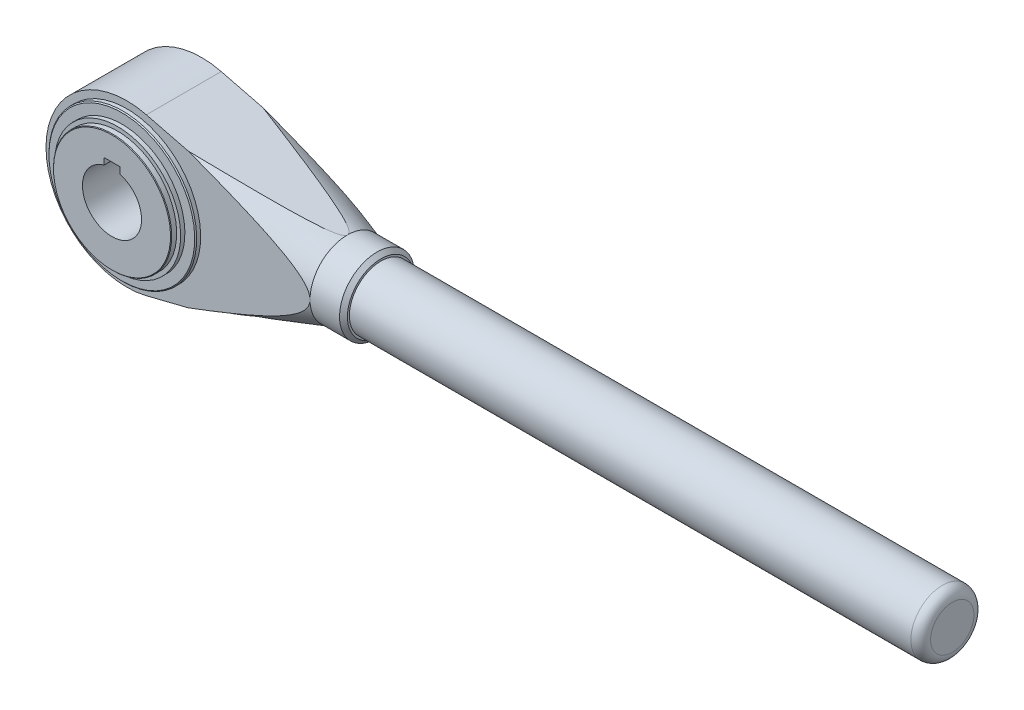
ISO-10303-21;
HEADER;
FILE_DESCRIPTION(('STEP AP214'),'2;1');
FILE_NAME('part.step','',(''),(''),'','','');
FILE_SCHEMA(('AUTOMOTIVE_DESIGN { 1 0 10303 214 1 1 1 1 }'));
ENDSEC;
DATA;
#1=APPLICATION_CONTEXT('core data for automotive mechanical design processes');
#2=APPLICATION_PROTOCOL_DEFINITION('international standard','automotive_design',2000,#1);
#3=PRODUCT_CONTEXT('',#1,'mechanical');
#4=PRODUCT('Part','Part','',(#3));
#5=PRODUCT_RELATED_PRODUCT_CATEGORY('part','',(#4));
#6=PRODUCT_DEFINITION_FORMATION('','',#4);
#7=PRODUCT_DEFINITION_CONTEXT('part definition',#1,'design');
#8=PRODUCT_DEFINITION('design','',#6,#7);
#9=PRODUCT_DEFINITION_SHAPE('','',#8);
#10=(LENGTH_UNIT() NAMED_UNIT(*) SI_UNIT(.MILLI.,.METRE.));
#11=(NAMED_UNIT(*) PLANE_ANGLE_UNIT() SI_UNIT($,.RADIAN.));
#12=(NAMED_UNIT(*) SI_UNIT($,.STERADIAN.) SOLID_ANGLE_UNIT());
#13=UNCERTAINTY_MEASURE_WITH_UNIT(LENGTH_MEASURE(1.E-05),#10,'distance_accuracy_value','');
#14=(GEOMETRIC_REPRESENTATION_CONTEXT(3) GLOBAL_UNCERTAINTY_ASSIGNED_CONTEXT((#13)) GLOBAL_UNIT_ASSIGNED_CONTEXT((#10,
#11,#12)) REPRESENTATION_CONTEXT('',''));
#15=CARTESIAN_POINT('',(0.,0.,0.));
#16=DIRECTION('',(0.,0.,1.));
#17=DIRECTION('',(1.,0.,0.));
#18=AXIS2_PLACEMENT_3D('',#15,#16,#17);
#19=CARTESIAN_POINT('',(93.,19.00000000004,45.5));
#20=DIRECTION('',(-0.242665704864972,-0.970109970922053,0.));
#21=DIRECTION('',(0.970109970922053,-0.242665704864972,0.));
#22=AXIS2_PLACEMENT_3D('',#19,#20,#21);
#23=PLANE('',#22);
#24=CARTESIAN_POINT('',(168.95671361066,0.,26.5));
#25=DIRECTION('',(-0.242665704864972,-0.970109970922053,0.));
#26=DIRECTION('',(-0.970109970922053,0.242665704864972,0.));
#27=AXIS2_PLACEMENT_3D('',#24,#25,#26);
#28=ELLIPSE('',#27,162.094068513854,39.3346713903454);
#29=CARTESIAN_POINT('',(31.249743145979,34.4463618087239,45.4911698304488));
#30=VERTEX_POINT('',#29);
#31=CARTESIAN_POINT('',(31.269211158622,34.4414920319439,45.5));
#32=VERTEX_POINT('',#31);
#33=EDGE_CURVE('E211',#30,#32,#28,.F.);
#34=ORIENTED_EDGE('',*,*,#33,.F.);
#35=CARTESIAN_POINT('',(31.249543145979,34.4464118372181,7.5087844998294));
#36=CARTESIAN_POINT('',(32.5832363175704,34.1127985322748,7.81334293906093));
#37=CARTESIAN_POINT('',(33.9167539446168,33.7792291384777,8.11872042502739));
#38=CARTESIAN_POINT('',(36.5833697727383,33.112195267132,8.73142755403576));
#39=CARTESIAN_POINT('',(37.9164679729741,32.7787307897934,9.03875720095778));
#40=CARTESIAN_POINT('',(40.5826330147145,32.1118096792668,9.65578836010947));
#41=CARTESIAN_POINT('',(41.9156996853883,31.7783530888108,9.96549065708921));
#42=CARTESIAN_POINT('',(44.5812439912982,31.1115872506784,10.5875723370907));
#43=CARTESIAN_POINT('',(45.9137216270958,30.7782780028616,10.8999517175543));
#44=CARTESIAN_POINT('',(48.5916928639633,30.1084036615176,11.5311368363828));
#45=CARTESIAN_POINT('',(49.9371791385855,29.7718404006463,11.8499756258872));
#46=CARTESIAN_POINT('',(52.6272664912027,29.0989353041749,12.4915959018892));
#47=CARTESIAN_POINT('',(53.9718675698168,28.7625934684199,12.8143773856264));
#48=CARTESIAN_POINT('',(56.6595518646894,28.0902894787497,13.4646871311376));
#49=CARTESIAN_POINT('',(58.0026354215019,27.7543272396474,13.7922138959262));
#50=CARTESIAN_POINT('',(60.6873916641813,27.0827556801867,14.453323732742));
#51=CARTESIAN_POINT('',(62.0290643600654,26.7471463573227,14.7869067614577));
#52=CARTESIAN_POINT('',(64.3937548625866,26.1556368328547,15.3821026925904));
#53=CARTESIAN_POINT('',(65.4171560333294,25.8996407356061,15.6420959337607));
#54=CARTESIAN_POINT('',(67.4626059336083,25.3879868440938,16.1676714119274));
#55=CARTESIAN_POINT('',(68.4846546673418,25.1323290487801,16.4332536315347));
#56=CARTESIAN_POINT('',(70.5278879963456,24.6212296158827,16.9716637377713));
#57=CARTESIAN_POINT('',(71.5490711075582,24.365788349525,17.2444976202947));
#58=CARTESIAN_POINT('',(73.5890647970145,23.8554992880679,17.7991880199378));
#59=CARTESIAN_POINT('',(74.6078755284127,23.6006514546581,18.0810439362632));
#60=CARTESIAN_POINT('',(76.6373725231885,23.0929880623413,18.6553869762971));
#61=CARTESIAN_POINT('',(77.6480742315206,22.8401686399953,18.9478159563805));
#62=CARTESIAN_POINT('',(79.6651902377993,22.3356022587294,19.5491561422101));
#63=CARTESIAN_POINT('',(80.6716033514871,22.0838555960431,19.8580716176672));
#64=CARTESIAN_POINT('',(82.1750548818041,21.7077785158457,20.3394444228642));
#65=CARTESIAN_POINT('',(82.6748375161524,21.5827616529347,20.5027840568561));
#66=CARTESIAN_POINT('',(83.6719817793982,21.3333335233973,20.8371163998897));
#67=CARTESIAN_POINT('',(84.1693434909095,21.2089222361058,21.0081088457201));
#68=CARTESIAN_POINT('',(85.1605785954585,20.9609722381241,21.3598564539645));
#69=CARTESIAN_POINT('',(85.6544533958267,20.8374331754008,21.5406073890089));
#70=CARTESIAN_POINT('',(86.6374982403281,20.5915319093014,21.9151764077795));
#71=CARTESIAN_POINT('',(87.1266690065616,20.4691695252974,22.1089924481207));
#72=CARTESIAN_POINT('',(87.7595827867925,20.3108509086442,22.3736748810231));
#73=CARTESIAN_POINT('',(87.9066290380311,20.2740683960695,22.4361599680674));
#74=CARTESIAN_POINT('',(88.1999359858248,20.200699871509,22.5630750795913));
#75=CARTESIAN_POINT('',(88.346196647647,20.1641138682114,22.6275051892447));
#76=CARTESIAN_POINT('',(88.7837368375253,20.0546664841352,22.8241261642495));
#77=CARTESIAN_POINT('',(89.0736488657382,19.9821471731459,22.9595956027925));
#78=CARTESIAN_POINT('',(89.6492345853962,19.8381687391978,23.2425470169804));
#79=CARTESIAN_POINT('',(89.9348888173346,19.766714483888,23.3900712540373));
#80=CARTESIAN_POINT('',(90.4978894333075,19.6258841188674,23.7009442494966));
#81=CARTESIAN_POINT('',(90.7752427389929,19.5565062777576,23.8642793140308));
#82=CARTESIAN_POINT('',(91.182240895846,19.4546987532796,24.1279560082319));
#83=CARTESIAN_POINT('',(91.3171853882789,19.4209434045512,24.2195691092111));
#84=CARTESIAN_POINT('',(91.5818937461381,19.3547286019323,24.4103826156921));
#85=CARTESIAN_POINT('',(91.7116602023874,19.322268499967,24.5095791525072));
#86=CARTESIAN_POINT('',(91.9628535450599,19.2594343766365,24.7169587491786));
#87=CARTESIAN_POINT('',(92.0843323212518,19.2290473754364,24.8250742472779));
#88=CARTESIAN_POINT('',(92.3157646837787,19.1711563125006,25.0535478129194));
#89=CARTESIAN_POINT('',(92.4257454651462,19.1436454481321,25.1738756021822));
#90=CARTESIAN_POINT('',(92.5996624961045,19.1001414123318,25.3954314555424));
#91=CARTESIAN_POINT('',(92.6679838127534,19.083051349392,25.4929448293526));
#92=CARTESIAN_POINT('',(92.7899247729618,19.0525487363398,25.6973881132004));
#93=CARTESIAN_POINT('',(92.8435749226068,19.0391285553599,25.8042978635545));
#94=CARTESIAN_POINT('',(92.9181550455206,19.020472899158,25.9969425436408));
#95=CARTESIAN_POINT('',(92.9440062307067,19.0140064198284,26.0806216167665));
#96=CARTESIAN_POINT('',(92.9818382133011,19.004543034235,26.25124775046));
#97=CARTESIAN_POINT('',(92.9938366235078,19.0015417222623,26.3381905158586));
#98=CARTESIAN_POINT('',(93.002495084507,18.9993758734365,26.5132483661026));
#99=CARTESIAN_POINT('',(92.9990960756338,19.000226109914,26.6013666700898));
#100=CARTESIAN_POINT('',(92.9772870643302,19.0056814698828,26.7756122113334));
#101=CARTESIAN_POINT('',(92.9588625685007,19.0102902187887,26.8617374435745));
#102=CARTESIAN_POINT('',(92.9024869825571,19.0243921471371,27.0523531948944));
#103=CARTESIAN_POINT('',(92.8606313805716,19.0348620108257,27.1555949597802));
#104=CARTESIAN_POINT('',(92.7616926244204,19.059610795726,27.3539666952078));
#105=CARTESIAN_POINT('',(92.7045732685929,19.0738987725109,27.4490766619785));
#106=CARTESIAN_POINT('',(92.5295419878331,19.1176815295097,27.7050321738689));
#107=CARTESIAN_POINT('',(92.3997347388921,19.1501518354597,27.8570829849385));
#108=CARTESIAN_POINT('',(92.1218597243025,19.2196601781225,28.1420622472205));
#109=CARTESIAN_POINT('',(91.9737309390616,19.2567134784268,28.2749234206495));
#110=CARTESIAN_POINT('',(91.6850679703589,19.3289203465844,28.5115206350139));
#111=CARTESIAN_POINT('',(91.5457389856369,19.3637724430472,28.6168400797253));
#112=CARTESIAN_POINT('',(91.2613942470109,19.434899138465,28.8190415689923));
#113=CARTESIAN_POINT('',(91.1163753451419,19.4711745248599,28.9159188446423));
#114=CARTESIAN_POINT('',(90.6748140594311,19.5816277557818,29.1970402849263));
#115=CARTESIAN_POINT('',(90.3723401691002,19.6572893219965,29.3713341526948));
#116=CARTESIAN_POINT('',(89.756949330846,19.8112247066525,29.7033034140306));
#117=CARTESIAN_POINT('',(89.443981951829,19.8895111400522,29.8608764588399));
#118=CARTESIAN_POINT('',(88.8127962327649,20.0473974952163,30.1631012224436));
#119=CARTESIAN_POINT('',(88.4945858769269,20.126995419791,30.3077707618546));
#120=CARTESIAN_POINT('',(87.8587621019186,20.2860419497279,30.5856641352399));
#121=CARTESIAN_POINT('',(87.5412022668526,20.3654771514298,30.7190194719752));
#122=CARTESIAN_POINT('',(86.9033088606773,20.5250413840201,30.9785088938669));
#123=CARTESIAN_POINT('',(86.5829751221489,20.6051704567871,31.1046425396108));
#124=CARTESIAN_POINT('',(85.6186950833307,20.8463778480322,31.4744959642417));
#125=CARTESIAN_POINT('',(84.9716427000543,21.0082331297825,31.7095948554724));
#126=CARTESIAN_POINT('',(83.671465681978,21.3334626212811,32.1644237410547));
#127=CARTESIAN_POINT('',(83.0183333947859,21.4968387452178,32.3841301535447));
#128=CARTESIAN_POINT('',(81.708631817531,21.8244507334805,32.8119555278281));
#129=CARTESIAN_POINT('',(81.0520630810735,21.9886864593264,33.0200762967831));
#130=CARTESIAN_POINT('',(79.7385825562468,22.3172437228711,33.4268460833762));
#131=CARTESIAN_POINT('',(79.0816793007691,22.4815631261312,33.6255245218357));
#132=CARTESIAN_POINT('',(77.7659338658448,22.8106869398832,34.0160180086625));
#133=CARTESIAN_POINT('',(77.1070916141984,22.9754913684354,34.2078327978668));
#134=CARTESIAN_POINT('',(75.7884491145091,23.3053398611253,34.5857734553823));
#135=CARTESIAN_POINT('',(75.1286500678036,23.4703836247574,34.7719037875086));
#136=CARTESIAN_POINT('',(73.8078717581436,23.80076637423,35.1396169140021));
#137=CARTESIAN_POINT('',(73.1468925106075,23.9661053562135,35.3211997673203));
#138=CARTESIAN_POINT('',(71.6312095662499,24.3452420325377,35.7329404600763));
#139=CARTESIAN_POINT('',(70.7761827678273,24.5591205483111,35.9618335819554));
#140=CARTESIAN_POINT('',(69.0648566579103,24.9871958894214,36.414513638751));
#141=CARTESIAN_POINT('',(68.2085573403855,25.2013927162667,36.6383005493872));
#142=CARTESIAN_POINT('',(65.6381048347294,25.8443720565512,37.3034150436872));
#143=CARTESIAN_POINT('',(63.9224287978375,26.2735354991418,37.7384878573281));
#144=CARTESIAN_POINT('',(60.4875847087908,27.1327358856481,38.5970921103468));
#145=CARTESIAN_POINT('',(58.7684154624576,27.5627731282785,39.0206184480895));
#146=CARTESIAN_POINT('',(55.3281019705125,28.4233416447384,39.8589647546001));
#147=CARTESIAN_POINT('',(53.6069577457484,28.8538729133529,40.2737848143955));
#148=CARTESIAN_POINT('',(50.1671356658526,29.7143185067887,41.0958425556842));
#149=CARTESIAN_POINT('',(48.4484612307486,30.1442319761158,41.5030954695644));
#150=CARTESIAN_POINT('',(45.0099588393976,31.0043474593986,42.3124200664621));
#151=CARTESIAN_POINT('',(43.2901308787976,31.4345494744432,42.7144917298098));
#152=CARTESIAN_POINT('',(39.8505862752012,32.2949256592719,43.514261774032));
#153=CARTESIAN_POINT('',(38.1308701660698,32.7250996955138,43.9119625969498));
#154=CARTESIAN_POINT('',(34.6907123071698,33.5856292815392,44.7039594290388));
#155=CARTESIAN_POINT('',(32.9702705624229,34.0159848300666,45.0982554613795));
#156=CARTESIAN_POINT('',(31.249543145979,34.4464118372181,45.4912155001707));
#157=B_SPLINE_CURVE_WITH_KNOTS('',3,(#35,#36,#37,#38,#39,#40,#41,#42,#43,#44,#45,#46,#47,#48,
#49,#50,#51,#52,#53,#54,#55,#56,#57,#58,#59,#60,#61,#62,#63,#64,#65,#66,#67,#68,#69,#70,#71,#72,
#73,#74,#75,#76,#77,#78,#79,#80,#81,#82,#83,#84,#85,#86,#87,#88,#89,#90,#91,#92,#93,#94,#95,#96,
#97,#98,#99,#100,#101,#102,#103,#104,#105,#106,#107,#108,#109,#110,#111,#112,#113,#114,#115,
#116,#117,#118,#119,#120,#121,#122,#123,#124,#125,#126,#127,#128,#129,#130,#131,#132,#133,#134,
#135,#136,#137,#138,#139,#140,#141,#142,#143,#144,#145,#146,#147,#148,#149,#150,#151,#152,#153,
#154,#155,#156),.UNSPECIFIED.,.F.,.F.,(4,2,2,2,2,2,2,2,2,2,2,2,2,2,2,2,2,2,2,2,2,2,2,2,2,2,2,2,
2,2,2,2,2,2,2,2,2,2,2,2,2,2,2,2,2,2,2,2,2,2,2,2,2,2,2,2,2,2,2,2,4),(0.,4.22434898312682,
8.44870636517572,12.6745270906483,16.900343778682,21.169694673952,25.4390425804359,
29.7070717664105,33.9750704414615,37.2345561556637,40.4940317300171,43.7562917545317,
47.0183349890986,50.2645689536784,53.5116477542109,55.1329700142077,56.7542365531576,
58.37480630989,59.9951231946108,60.4869643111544,60.9788269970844,61.9629711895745,
62.9507271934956,63.9376352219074,64.4371346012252,64.9363808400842,65.4321421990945,
65.9267031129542,66.286663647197,66.645869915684,66.9082938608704,67.1703837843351,
67.433479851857,67.696829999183,68.0306136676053,68.3651961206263,68.9694166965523,
69.5757067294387,70.1096009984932,70.6437949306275,71.7143834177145,72.7911869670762,
73.8664795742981,74.9267735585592,75.9871319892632,78.1084262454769,80.2329023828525,
82.3570462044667,84.474067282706,86.5911682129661,88.7065615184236,90.8219273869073,
93.5537311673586,96.285547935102,101.749282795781,107.215393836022,112.681447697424,
118.134941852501,123.588456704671,129.038751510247,134.489009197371),.UNSPECIFIED.);
#158=CARTESIAN_POINT('',(93.,19.00000000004,26.5));
#159=VERTEX_POINT('',#158);
#160=EDGE_CURVE('E263',#159,#30,#157,.T.);
#161=ORIENTED_EDGE('',*,*,#160,.F.);
#162=CARTESIAN_POINT('',(31.249743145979,34.4463618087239,7.5088301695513));
#163=VERTEX_POINT('',#162);
#164=EDGE_CURVE('E271',#163,#159,#157,.T.);
#165=ORIENTED_EDGE('',*,*,#164,.F.);
#166=CARTESIAN_POINT('',(31.269211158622,34.4414920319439,7.5));
#167=VERTEX_POINT('',#166);
#168=EDGE_CURVE('E206',#167,#163,#28,.F.);
#169=ORIENTED_EDGE('',*,*,#168,.F.);
#170=DIRECTION('',(-0.970109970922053,0.242665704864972,0.));
#171=VECTOR('',#170,1.);
#172=CARTESIAN_POINT('',(93.,19.00000000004,7.5));
#173=LINE('',#172,#171);
#174=CARTESIAN_POINT('',(9.94929389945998,39.774508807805,7.5));
#175=VERTEX_POINT('',#174);
#176=EDGE_CURVE('E357',#167,#175,#173,.T.);
#177=ORIENTED_EDGE('',*,*,#176,.T.);
#178=DIRECTION('',(0.,0.,-1.));
#179=VECTOR('',#178,1.);
#180=CARTESIAN_POINT('',(9.94929389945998,39.774508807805,45.5));
#181=LINE('',#180,#179);
#182=CARTESIAN_POINT('',(9.94929389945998,39.774508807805,45.5));
#183=VERTEX_POINT('',#182);
#184=EDGE_CURVE('E339',#183,#175,#181,.T.);
#185=ORIENTED_EDGE('',*,*,#184,.F.);
#186=DIRECTION('',(-0.970109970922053,0.242665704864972,0.));
#187=VECTOR('',#186,1.);
#188=CARTESIAN_POINT('',(93.,19.00000000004,45.5));
#189=LINE('',#188,#187);
#190=EDGE_CURVE('E347',#32,#183,#189,.T.);
#191=ORIENTED_EDGE('',*,*,#190,.F.);
#192=EDGE_LOOP('',(#34,#161,#165,#169,#177,#185,#191));
#193=FACE_BOUND('',#192,.T.);
#194=ADVANCED_FACE('F15',(#193),#23,.F.);
#195=CARTESIAN_POINT('',(93.,-19.00000000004,45.5));
#196=DIRECTION('',(0.242665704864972,-0.970109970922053,0.));
#197=DIRECTION('',(0.970109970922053,0.242665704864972,0.));
#198=AXIS2_PLACEMENT_3D('',#195,#196,#197);
#199=PLANE('',#198);
#200=CARTESIAN_POINT('',(31.249543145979,-34.4464118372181,7.5087844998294));
#201=CARTESIAN_POINT('',(32.5832363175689,-34.1127985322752,7.81334293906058));
#202=CARTESIAN_POINT('',(33.9167539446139,-33.7792291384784,8.11872042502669));
#203=CARTESIAN_POINT('',(36.5833697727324,-33.1121952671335,8.73142755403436));
#204=CARTESIAN_POINT('',(37.9164679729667,-32.7787307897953,9.03875720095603));
#205=CARTESIAN_POINT('',(40.5826330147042,-32.1118096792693,9.65578836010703));
#206=CARTESIAN_POINT('',(41.9156996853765,-31.7783530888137,9.96549065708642));
#207=CARTESIAN_POINT('',(44.5812439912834,-31.1115872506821,10.5875723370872));
#208=CARTESIAN_POINT('',(45.9137216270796,-30.7782780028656,10.8999517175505));
#209=CARTESIAN_POINT('',(48.591692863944,-30.1084036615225,11.5311368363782));
#210=CARTESIAN_POINT('',(49.9371791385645,-29.7718404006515,11.8499756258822));
#211=CARTESIAN_POINT('',(52.6272664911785,-29.0989353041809,12.4915959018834));
#212=CARTESIAN_POINT('',(53.9718675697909,-28.7625934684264,12.8143773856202));
#213=CARTESIAN_POINT('',(56.6595518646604,-28.0902894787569,13.4646871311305));
#214=CARTESIAN_POINT('',(58.0026354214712,-27.754327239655,13.7922138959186));
#215=CARTESIAN_POINT('',(60.6873916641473,-27.0827556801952,14.4533237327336));
#216=CARTESIAN_POINT('',(62.0290643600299,-26.7471463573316,14.7869067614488));
#217=CARTESIAN_POINT('',(64.393754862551,-26.1556368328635,15.3821026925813));
#218=CARTESIAN_POINT('',(65.4171560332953,-25.8996407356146,15.642095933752));
#219=CARTESIAN_POINT('',(67.4626059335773,-25.3879868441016,16.1676714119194));
#220=CARTESIAN_POINT('',(68.4846546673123,-25.1323290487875,16.433253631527));
#221=CARTESIAN_POINT('',(70.5278879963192,-24.6212296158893,16.9716637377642));
#222=CARTESIAN_POINT('',(71.5490711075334,-24.3657883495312,17.244497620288));
#223=CARTESIAN_POINT('',(73.5890647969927,-23.8554992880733,17.7991880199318));
#224=CARTESIAN_POINT('',(74.6078755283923,-23.6006514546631,18.0810439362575));
#225=CARTESIAN_POINT('',(76.6373725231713,-23.0929880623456,18.6553869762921));
#226=CARTESIAN_POINT('',(77.6480742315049,-22.8401686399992,18.9478159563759));
#227=CARTESIAN_POINT('',(79.6651902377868,-22.3356022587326,19.5491561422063));
#228=CARTESIAN_POINT('',(80.6716033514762,-22.0838555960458,19.8580716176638));
#229=CARTESIAN_POINT('',(82.1750548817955,-21.7077785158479,20.3394444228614));
#230=CARTESIAN_POINT('',(82.6748375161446,-21.5827616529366,20.5027840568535));
#231=CARTESIAN_POINT('',(83.6719817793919,-21.3333335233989,20.8371163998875));
#232=CARTESIAN_POINT('',(84.169343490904,-21.2089222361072,21.0081088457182));
#233=CARTESIAN_POINT('',(85.1605785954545,-20.960972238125,21.359856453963));
#234=CARTESIAN_POINT('',(85.6544533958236,-20.8374331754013,21.5406073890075));
#235=CARTESIAN_POINT('',(86.6374982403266,-20.5915319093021,21.915176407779));
#236=CARTESIAN_POINT('',(87.1266690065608,-20.4691695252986,22.1089924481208));
#237=CARTESIAN_POINT('',(87.7595827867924,-20.3108509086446,22.3736748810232));
#238=CARTESIAN_POINT('',(87.9066290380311,-20.2740683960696,22.4361599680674));
#239=CARTESIAN_POINT('',(88.1999359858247,-20.2006998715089,22.5630750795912));
#240=CARTESIAN_POINT('',(88.3461966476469,-20.1641138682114,22.6275051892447));
#241=CARTESIAN_POINT('',(88.7837368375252,-20.0546664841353,22.8241261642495));
#242=CARTESIAN_POINT('',(89.0736488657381,-19.982147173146,22.9595956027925));
#243=CARTESIAN_POINT('',(89.649234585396,-19.8381687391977,23.2425470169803));
#244=CARTESIAN_POINT('',(89.9348888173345,-19.7667144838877,23.390071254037));
#245=CARTESIAN_POINT('',(90.4978894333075,-19.6258841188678,23.7009442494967));
#246=CARTESIAN_POINT('',(90.7752427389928,-19.556506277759,23.8642793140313));
#247=CARTESIAN_POINT('',(91.1822408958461,-19.4546987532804,24.1279560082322));
#248=CARTESIAN_POINT('',(91.3171853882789,-19.4209434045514,24.2195691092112));
#249=CARTESIAN_POINT('',(91.5818937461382,-19.3547286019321,24.4103826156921));
#250=CARTESIAN_POINT('',(91.7116602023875,-19.3222684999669,24.5095791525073));
#251=CARTESIAN_POINT('',(91.9628535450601,-19.2594343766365,24.7169587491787));
#252=CARTESIAN_POINT('',(92.0843323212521,-19.2290473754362,24.8250742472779));
#253=CARTESIAN_POINT('',(92.3157646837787,-19.1711563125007,25.0535478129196));
#254=CARTESIAN_POINT('',(92.4257454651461,-19.1436454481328,25.1738756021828));
#255=CARTESIAN_POINT('',(92.5996624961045,-19.1001414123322,25.3954314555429));
#256=CARTESIAN_POINT('',(92.6679838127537,-19.0830513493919,25.4929448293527));
#257=CARTESIAN_POINT('',(92.7899247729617,-19.0525487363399,25.6973881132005));
#258=CARTESIAN_POINT('',(92.8435749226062,-19.0391285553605,25.8042978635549));
#259=CARTESIAN_POINT('',(92.9181550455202,-19.0204728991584,25.9969425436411));
#260=CARTESIAN_POINT('',(92.9440062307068,-19.0140064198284,26.0806216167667));
#261=CARTESIAN_POINT('',(92.9818382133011,-19.004543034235,26.2512477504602));
#262=CARTESIAN_POINT('',(92.9938366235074,-19.0015417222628,26.3381905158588));
#263=CARTESIAN_POINT('',(93.0024950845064,-18.999375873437,26.5132483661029));
#264=CARTESIAN_POINT('',(92.9990960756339,-19.0002261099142,26.6013666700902));
#265=CARTESIAN_POINT('',(92.9772870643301,-19.0056814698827,26.7756122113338));
#266=CARTESIAN_POINT('',(92.9588625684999,-19.0102902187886,26.8617374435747));
#267=CARTESIAN_POINT('',(92.902486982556,-19.0243921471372,27.0523531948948));
#268=CARTESIAN_POINT('',(92.8606313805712,-19.0348620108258,27.1555949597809));
#269=CARTESIAN_POINT('',(92.7616926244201,-19.0596107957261,27.3539666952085));
#270=CARTESIAN_POINT('',(92.7045732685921,-19.0738987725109,27.4490766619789));
#271=CARTESIAN_POINT('',(92.5295419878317,-19.1176815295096,27.7050321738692));
#272=CARTESIAN_POINT('',(92.3997347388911,-19.1501518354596,27.8570829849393));
#273=CARTESIAN_POINT('',(92.1218597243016,-19.219660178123,28.1420622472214));
#274=CARTESIAN_POINT('',(91.9737309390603,-19.2567134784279,28.2749234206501));
#275=CARTESIAN_POINT('',(91.6850679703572,-19.3289203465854,28.5115206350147));
#276=CARTESIAN_POINT('',(91.5457389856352,-19.3637724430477,28.6168400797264));
#277=CARTESIAN_POINT('',(91.261394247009,-19.4348991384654,28.8190415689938));
#278=CARTESIAN_POINT('',(91.1163753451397,-19.4711745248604,28.9159188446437));
#279=CARTESIAN_POINT('',(90.6748140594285,-19.5816277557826,29.1970402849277));
#280=CARTESIAN_POINT('',(90.3723401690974,-19.6572893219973,29.3713341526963));
#281=CARTESIAN_POINT('',(89.7569493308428,-19.8112247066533,29.7033034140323));
#282=CARTESIAN_POINT('',(89.4439819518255,-19.8895111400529,29.8608764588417));
#283=CARTESIAN_POINT('',(88.8127962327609,-20.0473974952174,30.1631012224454));
#284=CARTESIAN_POINT('',(88.4945858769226,-20.1269954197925,30.3077707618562));
#285=CARTESIAN_POINT('',(87.8587621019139,-20.2860419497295,30.5856641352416));
#286=CARTESIAN_POINT('',(87.5412022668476,-20.3654771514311,30.7190194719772));
#287=CARTESIAN_POINT('',(86.9033088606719,-20.5250413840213,30.9785088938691));
#288=CARTESIAN_POINT('',(86.5829751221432,-20.6051704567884,31.104642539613));
#289=CARTESIAN_POINT('',(85.6186950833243,-20.8463778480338,31.474495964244));
#290=CARTESIAN_POINT('',(84.9716427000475,-21.0082331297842,31.7095948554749));
#291=CARTESIAN_POINT('',(83.6714656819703,-21.333462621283,32.1644237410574));
#292=CARTESIAN_POINT('',(83.0183333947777,-21.4968387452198,32.3841301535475));
#293=CARTESIAN_POINT('',(81.708631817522,-21.8244507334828,32.811955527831));
#294=CARTESIAN_POINT('',(81.0520630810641,-21.9886864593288,33.0200762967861));
#295=CARTESIAN_POINT('',(79.7385825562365,-22.3172437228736,33.4268460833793));
#296=CARTESIAN_POINT('',(79.0816793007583,-22.4815631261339,33.6255245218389));
#297=CARTESIAN_POINT('',(77.7659338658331,-22.8106869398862,34.016018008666));
#298=CARTESIAN_POINT('',(77.1070916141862,-22.9754913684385,34.2078327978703));
#299=CARTESIAN_POINT('',(75.7884491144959,-23.3053398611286,34.5857734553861));
#300=CARTESIAN_POINT('',(75.1286500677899,-23.4703836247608,34.7719037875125));
#301=CARTESIAN_POINT('',(73.8078717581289,-23.8007663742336,35.1396169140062));
#302=CARTESIAN_POINT('',(73.1468925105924,-23.9661053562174,35.3211997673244));
#303=CARTESIAN_POINT('',(71.6312095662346,-24.3452420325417,35.7329404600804));
#304=CARTESIAN_POINT('',(70.7761827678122,-24.5591205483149,35.9618335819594));
#305=CARTESIAN_POINT('',(69.0648566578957,-24.9871958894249,36.4145136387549));
#306=CARTESIAN_POINT('',(68.2085573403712,-25.2013927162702,36.6383005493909));
#307=CARTESIAN_POINT('',(65.6381048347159,-25.8443720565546,37.3034150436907));
#308=CARTESIAN_POINT('',(63.9224287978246,-26.273535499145,37.7384878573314));
#309=CARTESIAN_POINT('',(60.487584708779,-27.132735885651,38.5970921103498));
#310=CARTESIAN_POINT('',(58.7684154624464,-27.5627731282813,39.0206184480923));
#311=CARTESIAN_POINT('',(55.3281019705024,-28.4233416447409,39.8589647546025));
#312=CARTESIAN_POINT('',(53.6069577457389,-28.8538729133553,40.2737848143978));
#313=CARTESIAN_POINT('',(50.1671356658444,-29.7143185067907,41.0958425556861));
#314=CARTESIAN_POINT('',(48.4484612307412,-30.1442319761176,41.5030954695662));
#315=CARTESIAN_POINT('',(45.0099588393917,-31.0043474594,42.3124200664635));
#316=CARTESIAN_POINT('',(43.2901308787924,-31.4345494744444,42.714491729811));
#317=CARTESIAN_POINT('',(39.8505862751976,-32.2949256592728,43.5142617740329));
#318=CARTESIAN_POINT('',(38.1308701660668,-32.7250996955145,43.9119625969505));
#319=CARTESIAN_POINT('',(34.6907123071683,-33.5856292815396,44.7039594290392));
#320=CARTESIAN_POINT('',(32.9702705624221,-34.0159848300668,45.0982554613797));
#321=CARTESIAN_POINT('',(31.249543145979,-34.4464118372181,45.4912155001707));
#322=B_SPLINE_CURVE_WITH_KNOTS('',3,(#200,#201,#202,#203,#204,#205,#206,#207,#208,#209,#210,
#211,#212,#213,#214,#215,#216,#217,#218,#219,#220,#221,#222,#223,#224,#225,#226,#227,#228,#229,
#230,#231,#232,#233,#234,#235,#236,#237,#238,#239,#240,#241,#242,#243,#244,#245,#246,#247,#248,
#249,#250,#251,#252,#253,#254,#255,#256,#257,#258,#259,#260,#261,#262,#263,#264,#265,#266,#267,
#268,#269,#270,#271,#272,#273,#274,#275,#276,#277,#278,#279,#280,#281,#282,#283,#284,#285,#286,
#287,#288,#289,#290,#291,#292,#293,#294,#295,#296,#297,#298,#299,#300,#301,#302,#303,#304,#305,
#306,#307,#308,#309,#310,#311,#312,#313,#314,#315,#316,#317,#318,#319,#320,#321),.UNSPECIFIED.,
.F.,.F.,(4,2,2,2,2,2,2,2,2,2,2,2,2,2,2,2,2,2,2,2,2,2,2,2,2,2,2,2,2,2,2,2,2,2,2,2,2,2,2,2,2,2,2,
2,2,2,2,2,2,2,2,2,2,2,2,2,2,2,2,2,4),(0.,4.22434898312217,8.4487063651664,12.6745270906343,
16.9003437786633,21.1696946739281,25.4390425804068,29.7070717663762,33.9750704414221,
37.2345561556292,40.4940317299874,43.7562917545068,47.0183349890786,50.2645689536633,
53.5116477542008,55.1329700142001,56.7542365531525,58.3748063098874,59.9951231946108,
60.4869643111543,60.9788269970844,61.9629711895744,62.9507271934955,63.9376352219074,
64.4371346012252,64.9363808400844,65.4321421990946,65.9267031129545,66.2866636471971,
66.6458699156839,66.9082938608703,67.1703837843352,67.4334798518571,67.6968299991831,
68.0306136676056,68.3651961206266,68.9694166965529,69.5757067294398,70.1096009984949,
70.6437949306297,71.7143834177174,72.7911869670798,73.8664795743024,74.9267735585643,
75.9871319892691,78.1084262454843,80.2329023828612,82.3570462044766,84.4740672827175,
86.5911682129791,88.7065615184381,90.8219273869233,93.5537311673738,96.2855479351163,
101.749282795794,107.215393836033,112.681447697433,118.134941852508,123.588456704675,
129.038751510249,134.489009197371),.UNSPECIFIED.);
#323=CARTESIAN_POINT('',(93.,-19.00000000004,26.5));
#324=VERTEX_POINT('',#323);
#325=CARTESIAN_POINT('',(31.249743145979,-34.4463618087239,45.4911698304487));
#326=VERTEX_POINT('',#325);
#327=EDGE_CURVE('E230',#324,#326,#322,.T.);
#328=ORIENTED_EDGE('',*,*,#327,.T.);
#329=CARTESIAN_POINT('',(168.95671361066,0.,26.5));
#330=DIRECTION('',(0.242665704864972,-0.970109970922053,0.));
#331=DIRECTION('',(-0.970109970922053,-0.242665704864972,0.));
#332=AXIS2_PLACEMENT_3D('',#329,#330,#331);
#333=ELLIPSE('',#332,162.094068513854,39.3346713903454);
#334=CARTESIAN_POINT('',(31.2692111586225,-34.441492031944,45.5));
#335=VERTEX_POINT('',#334);
#336=EDGE_CURVE('E207',#326,#335,#333,.F.);
#337=ORIENTED_EDGE('',*,*,#336,.T.);
#338=DIRECTION('',(-0.970109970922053,-0.242665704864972,0.));
#339=VECTOR('',#338,1.);
#340=CARTESIAN_POINT('',(93.,-19.00000000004,45.5));
#341=LINE('',#340,#339);
#342=CARTESIAN_POINT('',(9.94929389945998,-39.774508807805,45.5));
#343=VERTEX_POINT('',#342);
#344=EDGE_CURVE('E354',#335,#343,#341,.T.);
#345=ORIENTED_EDGE('',*,*,#344,.T.);
#346=DIRECTION('',(0.,0.,-1.));
#347=VECTOR('',#346,1.);
#348=CARTESIAN_POINT('',(9.94929389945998,-39.774508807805,45.5));
#349=LINE('',#348,#347);
#350=CARTESIAN_POINT('',(9.94929389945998,-39.774508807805,7.5));
#351=VERTEX_POINT('',#350);
#352=EDGE_CURVE('E343',#343,#351,#349,.T.);
#353=ORIENTED_EDGE('',*,*,#352,.T.);
#354=DIRECTION('',(-0.970109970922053,-0.242665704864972,0.));
#355=VECTOR('',#354,1.);
#356=CARTESIAN_POINT('',(93.,-19.00000000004,7.5));
#357=LINE('',#356,#355);
#358=CARTESIAN_POINT('',(31.2692111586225,-34.441492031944,7.5));
#359=VERTEX_POINT('',#358);
#360=EDGE_CURVE('E364',#359,#351,#357,.T.);
#361=ORIENTED_EDGE('',*,*,#360,.F.);
#362=CARTESIAN_POINT('',(31.249743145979,-34.4463618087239,7.50883016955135));
#363=VERTEX_POINT('',#362);
#364=EDGE_CURVE('E201',#359,#363,#333,.F.);
#365=ORIENTED_EDGE('',*,*,#364,.T.);
#366=EDGE_CURVE('E272',#363,#324,#322,.T.);
#367=ORIENTED_EDGE('',*,*,#366,.T.);
#368=EDGE_LOOP('',(#328,#337,#345,#353,#361,#365,#367));
#369=FACE_BOUND('',#368,.T.);
#370=ADVANCED_FACE('F279',(#369),#199,.T.);
#371=CARTESIAN_POINT('',(0.,0.,45.5));
#372=DIRECTION('',(0.,0.,1.));
#373=DIRECTION('',(1.,0.,0.));
#374=AXIS2_PLACEMENT_3D('',#371,#372,#373);
#375=PLANE('',#374);
#376=CARTESIAN_POINT('',(0.,-2.99760216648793E-12,45.5000000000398));
#377=DIRECTION('',(0.,0.,1.));
#378=DIRECTION('',(0.,-1.,0.));
#379=AXIS2_PLACEMENT_3D('',#376,#377,#378);
#380=CIRCLE('',#379,37.5);
#381=CARTESIAN_POINT('',(0.,-37.500000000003,45.5000000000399));
#382=VERTEX_POINT('',#381);
#383=EDGE_CURVE('E367',#382,#382,#380,.T.);
#384=ORIENTED_EDGE('',*,*,#383,.F.);
#385=EDGE_LOOP('',(#384));
#386=FACE_BOUND('',#385,.T.);
#387=CARTESIAN_POINT('',(-12.6944196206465,-50.3393882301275,45.5));
#388=CARTESIAN_POINT('',(-10.5106165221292,-49.5707067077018,45.5));
#389=CARTESIAN_POINT('',(-8.3274843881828,-48.8001142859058,45.5));
#390=CARTESIAN_POINT('',(-3.96280622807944,-47.2544304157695,45.5));
#391=CARTESIAN_POINT('',(-1.78126020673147,-46.4793389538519,45.5));
#392=CARTESIAN_POINT('',(2.58068821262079,-44.92373482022,45.5));
#393=CARTESIAN_POINT('',(4.76109001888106,-44.1432204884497,45.5));
#394=CARTESIAN_POINT('',(9.11971953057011,-42.5761493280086,45.5));
#395=CARTESIAN_POINT('',(11.2979472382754,-41.7895925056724,45.5));
#396=CARTESIAN_POINT('',(15.6634615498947,-40.2051424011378,45.5));
#397=CARTESIAN_POINT('',(17.8507343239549,-39.4072109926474,45.5));
#398=CARTESIAN_POINT('',(22.2221380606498,-37.8027874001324,45.5));
#399=CARTESIAN_POINT('',(24.4062690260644,-36.9962952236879,45.5));
#400=CARTESIAN_POINT('',(28.7701139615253,-35.3732001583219,45.5));
#401=CARTESIAN_POINT('',(30.9498289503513,-34.5566000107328,45.5));
#402=CARTESIAN_POINT('',(35.3044847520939,-32.9107823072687,45.5));
#403=CARTESIAN_POINT('',(37.4794255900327,-32.0815648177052,45.5));
#404=CARTESIAN_POINT('',(41.3693668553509,-30.5823254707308,45.5));
#405=CARTESIAN_POINT('',(43.0855015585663,-29.915248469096,45.5));
#406=CARTESIAN_POINT('',(46.5130968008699,-28.5691969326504,45.5));
#407=CARTESIAN_POINT('',(48.2245573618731,-27.8902224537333,45.5));
#408=CARTESIAN_POINT('',(51.6428752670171,-26.5171833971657,45.5));
#409=CARTESIAN_POINT('',(53.3497283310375,-25.8231081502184,45.5));
#410=CARTESIAN_POINT('',(56.7558704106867,-24.4167531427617,45.5));
#411=CARTESIAN_POINT('',(58.4551597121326,-23.7044740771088,45.5));
#412=CARTESIAN_POINT('',(60.9963067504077,-22.6186661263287,45.5));
#413=CARTESIAN_POINT('',(61.8419096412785,-22.2538977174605,45.5));
#414=CARTESIAN_POINT('',(63.5301930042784,-21.5176644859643,45.5));
#415=CARTESIAN_POINT('',(64.372873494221,-21.1461997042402,45.5));
#416=CARTESIAN_POINT('',(66.0549447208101,-20.3954965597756,45.5));
#417=CARTESIAN_POINT('',(66.8943348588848,-20.0162568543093,45.5));
#418=CARTESIAN_POINT('',(68.569006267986,-19.2488121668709,45.5));
#419=CARTESIAN_POINT('',(69.4042875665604,-18.8606072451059,45.5));
#420=CARTESIAN_POINT('',(71.0687913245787,-18.0741735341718,45.5));
#421=CARTESIAN_POINT('',(71.8980202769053,-17.6759585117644,45.5));
#422=CARTESIAN_POINT('',(73.5503996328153,-16.8670131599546,45.5));
#423=CARTESIAN_POINT('',(74.3735498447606,-16.4562824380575,45.5));
#424=CARTESIAN_POINT('',(76.0119053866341,-15.6198597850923,45.5));
#425=CARTESIAN_POINT('',(76.8271131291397,-15.1941725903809,45.5));
#426=CARTESIAN_POINT('',(78.4475838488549,-14.3243246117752,45.5));
#427=CARTESIAN_POINT('',(79.2528477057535,-13.8801654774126,45.5));
#428=CARTESIAN_POINT('',(80.4534069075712,-13.1950153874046,45.5));
#429=CARTESIAN_POINT('',(80.8536559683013,-12.9626959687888,45.5));
#430=CARTESIAN_POINT('',(81.650213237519,-12.4913657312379,45.5));
#431=CARTESIAN_POINT('',(82.0465213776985,-12.2523547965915,45.5));
#432=CARTESIAN_POINT('',(82.8347562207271,-11.7665386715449,45.5));
#433=CARTESIAN_POINT('',(83.2266793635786,-11.5197276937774,45.5));
#434=CARTESIAN_POINT('',(84.0048817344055,-11.0173587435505,45.5));
#435=CARTESIAN_POINT('',(84.3911610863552,-10.7618009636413,45.5));
#436=CARTESIAN_POINT('',(85.1559820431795,-10.2411391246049,45.5));
#437=CARTESIAN_POINT('',(85.5345390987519,-9.97605783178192,45.5));
#438=CARTESIAN_POINT('',(86.2832013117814,-9.43408443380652,45.5));
#439=CARTESIAN_POINT('',(86.653305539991,-9.15719103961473,45.5));
#440=CARTESIAN_POINT('',(87.3823206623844,-8.58985434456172,45.5));
#441=CARTESIAN_POINT('',(87.7412443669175,-8.29942758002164,45.5));
#442=CARTESIAN_POINT('',(88.4451131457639,-7.70218492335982,45.5));
#443=CARTESIAN_POINT('',(88.7900625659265,-7.39537419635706,45.5));
#444=CARTESIAN_POINT('',(89.3971512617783,-6.82273227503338,45.5));
#445=CARTESIAN_POINT('',(89.6624940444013,-6.56031202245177,45.5));
#446=CARTESIAN_POINT('',(90.1777546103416,-6.02045848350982,45.5));
#447=CARTESIAN_POINT('',(90.4276671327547,-5.74302013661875,45.5));
#448=CARTESIAN_POINT('',(90.906433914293,-5.17188509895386,45.5));
#449=CARTESIAN_POINT('',(91.1353543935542,-4.87824456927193,45.5));
#450=CARTESIAN_POINT('',(91.5662852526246,-4.27207940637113,45.5));
#451=CARTESIAN_POINT('',(91.768320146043,-3.95957235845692,45.5));
#452=CARTESIAN_POINT('',(92.1525854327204,-3.28634327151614,45.5));
#453=CARTESIAN_POINT('',(92.3316973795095,-2.92377864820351,45.5));
#454=CARTESIAN_POINT('',(92.5581802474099,-2.36310400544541,45.5));
#455=CARTESIAN_POINT('',(92.6266390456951,-2.1734272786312,45.5));
#456=CARTESIAN_POINT('',(92.7476716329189,-1.78910918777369,45.5));
#457=CARTESIAN_POINT('',(92.8002532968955,-1.59447033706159,45.5));
#458=CARTESIAN_POINT('',(92.8883755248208,-1.19896164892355,45.5));
#459=CARTESIAN_POINT('',(92.9237107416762,-0.998045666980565,45.5));
#460=CARTESIAN_POINT('',(92.9750919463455,-0.593743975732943,45.5));
#461=CARTESIAN_POINT('',(92.9911387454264,-0.390358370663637,45.5));
#462=CARTESIAN_POINT('',(93.0032904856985,0.0169630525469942,45.5));
#463=CARTESIAN_POINT('',(92.9994002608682,0.220898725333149,45.5));
#464=CARTESIAN_POINT('',(92.9718491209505,0.627415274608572,45.5));
#465=CARTESIAN_POINT('',(92.9481887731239,0.829996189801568,45.5));
#466=CARTESIAN_POINT('',(92.8860511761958,1.20766695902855,45.5));
#467=CARTESIAN_POINT('',(92.8497153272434,1.38311499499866,45.5));
#468=CARTESIAN_POINT('',(92.7635246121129,1.73068272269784,45.5));
#469=CARTESIAN_POINT('',(92.7136649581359,1.9028012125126,45.5));
#470=CARTESIAN_POINT('',(92.5455906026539,2.41305940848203,45.5));
#471=CARTESIAN_POINT('',(92.4088631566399,2.74520046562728,45.5));
#472=CARTESIAN_POINT('',(92.1155145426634,3.35137043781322,45.5));
#473=CARTESIAN_POINT('',(91.963259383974,3.62758591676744,45.5));
#474=CARTESIAN_POINT('',(91.6349707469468,4.16568568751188,45.5));
#475=CARTESIAN_POINT('',(91.4589192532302,4.42755890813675,45.5));
#476=CARTESIAN_POINT('',(91.0876849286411,4.93844576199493,45.5));
#477=CARTESIAN_POINT('',(90.892445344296,5.18741770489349,45.5));
#478=CARTESIAN_POINT('',(90.4873063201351,5.67290819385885,45.5));
#479=CARTESIAN_POINT('',(90.2774112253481,5.9094303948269,45.5));
#480=CARTESIAN_POINT('',(89.7393148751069,6.48567418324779,45.5));
#481=CARTESIAN_POINT('',(89.4039006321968,6.8186441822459,45.5));
#482=CARTESIAN_POINT('',(88.7140068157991,7.46434516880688,45.5));
#483=CARTESIAN_POINT('',(88.359516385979,7.77706440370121,45.5));
#484=CARTESIAN_POINT('',(87.6355802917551,8.38614606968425,45.5));
#485=CARTESIAN_POINT('',(87.2661053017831,8.68247344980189,45.5));
#486=CARTESIAN_POINT('',(86.5162660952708,9.26077025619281,45.5));
#487=CARTESIAN_POINT('',(86.1359041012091,9.5427425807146,45.5));
#488=CARTESIAN_POINT('',(85.3639749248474,10.0964393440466,45.5));
#489=CARTESIAN_POINT('',(84.9723499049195,10.3680828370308,45.5));
#490=CARTESIAN_POINT('',(84.1820568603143,10.900925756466,45.5));
#491=CARTESIAN_POINT('',(83.7833885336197,11.1621247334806,45.5));
#492=CARTESIAN_POINT('',(82.980836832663,11.675177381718,45.5));
#493=CARTESIAN_POINT('',(82.5769610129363,11.9270429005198,45.5));
#494=CARTESIAN_POINT('',(81.7644683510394,12.4229550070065,45.5));
#495=CARTESIAN_POINT('',(81.3558516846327,12.6670018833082,45.5));
#496=CARTESIAN_POINT('',(80.4763698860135,13.182390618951,45.5));
#497=CARTESIAN_POINT('',(80.0048967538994,13.4526937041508,45.5));
#498=CARTESIAN_POINT('',(79.0575958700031,13.9855734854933,45.5));
#499=CARTESIAN_POINT('',(78.5817679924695,14.2481499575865,45.5));
#500=CARTESIAN_POINT('',(77.6263874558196,14.7665693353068,45.5));
#501=CARTESIAN_POINT('',(77.1468343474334,15.0224114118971,45.5));
#502=CARTESIAN_POINT('',(76.1845888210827,15.5281282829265,45.5));
#503=CARTESIAN_POINT('',(75.7018963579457,15.7780029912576,45.5));
#504=CARTESIAN_POINT('',(74.2492847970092,16.5199628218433,45.5));
#505=CARTESIAN_POINT('',(73.2753143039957,17.0041236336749,45.5));
#506=CARTESIAN_POINT('',(71.3192451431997,17.9555010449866,45.5));
#507=CARTESIAN_POINT('',(70.3371469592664,18.4227186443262,45.5));
#508=CARTESIAN_POINT('',(68.3644089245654,19.3442865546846,45.5));
#509=CARTESIAN_POINT('',(67.3737553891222,19.798607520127,45.5));
#510=CARTESIAN_POINT('',(65.3872301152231,20.6957042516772,45.5));
#511=CARTESIAN_POINT('',(64.3913583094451,21.1384798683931,45.5));
#512=CARTESIAN_POINT('',(62.3956432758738,22.0141681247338,45.5));
#513=CARTESIAN_POINT('',(61.3958013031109,22.4470836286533,45.5));
#514=CARTESIAN_POINT('',(59.3925753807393,23.3046174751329,45.5));
#515=CARTESIAN_POINT('',(58.3891914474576,23.7292358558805,45.5));
#516=CARTESIAN_POINT('',(56.3810538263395,24.5706503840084,45.5));
#517=CARTESIAN_POINT('',(55.376304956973,24.9874580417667,45.5));
#518=CARTESIAN_POINT('',(53.3642586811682,25.8148798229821,45.5));
#519=CARTESIAN_POINT('',(52.3569612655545,26.2254939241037,45.5));
#520=CARTESIAN_POINT('',(49.3316623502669,27.4492839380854,45.5));
#521=CARTESIAN_POINT('',(47.3103809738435,28.2543546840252,45.5));
#522=CARTESIAN_POINT('',(43.2637079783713,29.8466291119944,45.5));
#523=CARTESIAN_POINT('',(41.2383245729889,30.6338537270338,45.5));
#524=CARTESIAN_POINT('',(38.1963796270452,31.8045418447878,45.5));
#525=CARTESIAN_POINT('',(37.181765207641,32.1930751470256,45.5));
#526=CARTESIAN_POINT('',(35.1513715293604,32.9670862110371,45.5));
#527=CARTESIAN_POINT('',(34.1355922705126,33.352563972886,45.5));
#528=CARTESIAN_POINT('',(31.268077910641,34.4363098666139,45.5));
#529=CARTESIAN_POINT('',(29.4151352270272,35.1313835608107,45.5));
#530=CARTESIAN_POINT('',(25.706383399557,36.513845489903,45.5));
#531=CARTESIAN_POINT('',(23.8505742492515,37.2012337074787,45.5));
#532=CARTESIAN_POINT('',(20.1365319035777,38.5694775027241,45.5));
#533=CARTESIAN_POINT('',(18.2782986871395,39.2503330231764,45.5));
#534=CARTESIAN_POINT('',(14.5597850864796,40.6064238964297,45.5));
#535=CARTESIAN_POINT('',(12.699504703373,41.2816592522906,45.5));
#536=CARTESIAN_POINT('',(7.11589379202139,43.3001539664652,45.5));
#537=CARTESIAN_POINT('',(3.38993693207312,44.6361492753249,45.5));
#538=CARTESIAN_POINT('',(-4.06724633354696,47.2933510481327,45.5));
#539=CARTESIAN_POINT('',(-7.79847274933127,48.6145574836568,45.5));
#540=CARTESIAN_POINT('',(-13.3996794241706,50.5880888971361,45.5));
#541=CARTESIAN_POINT('',(-15.2681233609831,51.2447787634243,45.5));
#542=CARTESIAN_POINT('',(-19.0059253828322,52.5555448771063,45.5));
#543=CARTESIAN_POINT('',(-20.8752834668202,53.2096211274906,45.5));
#544=CARTESIAN_POINT('',(-26.484584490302,55.1683521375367,45.5));
#545=CARTESIAN_POINT('',(-30.2257495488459,56.4695075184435,45.5));
#546=CARTESIAN_POINT('',(-37.7106222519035,59.0642091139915,45.5));
#547=CARTESIAN_POINT('',(-41.4543298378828,60.3577554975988,45.5));
#548=CARTESIAN_POINT('',(-48.9439004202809,62.9385877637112,45.5));
#549=CARTESIAN_POINT('',(-52.689763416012,64.2258736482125,45.5));
#550=CARTESIAN_POINT('',(-60.1322976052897,66.7777363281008,45.5));
#551=CARTESIAN_POINT('',(-63.8289445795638,68.0423837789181,45.5));
#552=CARTESIAN_POINT('',(-71.2237105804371,70.5673671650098,45.5));
#553=CARTESIAN_POINT('',(-74.9218296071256,71.8277031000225,45.5));
#554=CARTESIAN_POINT('',(-86.0181068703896,75.6032370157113,45.5));
#555=CARTESIAN_POINT('',(-93.4181338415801,78.1129434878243,45.5));
#556=CARTESIAN_POINT('',(-104.517708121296,81.8682144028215,45.5));
#557=CARTESIAN_POINT('',(-108.215869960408,83.1178783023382,45.5));
#558=CARTESIAN_POINT('',(-115.613004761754,85.614804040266,45.5));
#559=CARTESIAN_POINT('',(-119.311977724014,86.8620658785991,45.5));
#560=CARTESIAN_POINT('',(-126.710599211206,89.354474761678,45.5));
#561=CARTESIAN_POINT('',(-130.410247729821,90.5996218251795,45.5));
#562=CARTESIAN_POINT('',(-137.81017232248,93.0880483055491,45.5));
#563=CARTESIAN_POINT('',(-141.510448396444,94.3313277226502,45.5));
#564=CARTESIAN_POINT('',(-145.21099822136,95.573791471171,45.5));
#565=B_SPLINE_CURVE_WITH_KNOTS('',3,(#387,#388,#389,#390,#391,#392,#393,#394,#395,#396,#397,
#398,#399,#400,#401,#402,#403,#404,#405,#406,#407,#408,#409,#410,#411,#412,#413,#414,#415,#416,
#417,#418,#419,#420,#421,#422,#423,#424,#425,#426,#427,#428,#429,#430,#431,#432,#433,#434,#435,
#436,#437,#438,#439,#440,#441,#442,#443,#444,#445,#446,#447,#448,#449,#450,#451,#452,#453,#454,
#455,#456,#457,#458,#459,#460,#461,#462,#463,#464,#465,#466,#467,#468,#469,#470,#471,#472,#473,
#474,#475,#476,#477,#478,#479,#480,#481,#482,#483,#484,#485,#486,#487,#488,#489,#490,#491,#492,
#493,#494,#495,#496,#497,#498,#499,#500,#501,#502,#503,#504,#505,#506,#507,#508,#509,#510,#511,
#512,#513,#514,#515,#516,#517,#518,#519,#520,#521,#522,#523,#524,#525,#526,#527,#528,#529,#530,
#531,#532,#533,#534,#535,#536,#537,#538,#539,#540,#541,#542,#543,#544,#545,#546,#547,#548,#549,
#550,#551,#552,#553,#554,#555,#556,#557,#558,#559,#560,#561,#562,#563,#564),.UNSPECIFIED.,.F.,
.F.,(4,2,2,2,2,2,2,2,2,2,2,2,2,2,2,2,2,2,2,2,2,2,2,2,2,2,2,2,2,2,2,2,2,2,2,2,2,2,2,2,2,2,2,2,2,
2,2,2,2,2,2,2,2,2,2,2,2,2,2,2,2,2,2,2,2,2,2,2,2,2,2,2,2,2,2,2,2,2,2,2,2,2,2,2,2,2,2,2,4),(0.,
6.94541757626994,13.8908561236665,20.8385237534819,27.7861841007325,34.7709893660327,
41.7557884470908,48.7387330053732,55.7216408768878,61.2452814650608,66.76889611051,
72.2965490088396,77.8239912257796,80.5867389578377,83.3494698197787,86.1126818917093,
88.8758754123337,91.6354568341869,94.3951248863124,97.1539267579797,99.9124827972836,
101.300791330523,102.689123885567,104.078511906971,105.467869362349,106.854101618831,
108.240485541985,109.625217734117,111.009515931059,112.128592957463,113.248049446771,
114.363843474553,115.478613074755,116.687630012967,117.292019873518,117.896109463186,
118.507226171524,119.118317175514,119.729260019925,120.340185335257,120.87712493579,
121.414254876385,122.488217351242,123.433102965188,124.378707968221,125.327199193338,
126.27541039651,127.692126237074,129.109657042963,130.530110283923,131.950275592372,
133.379918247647,134.809622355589,136.237444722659,137.66521432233,139.295512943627,
140.925858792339,142.556404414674,144.186973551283,147.449756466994,150.71234652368,
153.981846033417,157.251387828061,160.519967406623,163.788531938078,167.051825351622,
170.3151305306,176.842152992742,183.361075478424,186.620458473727,189.879841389,195.81688197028,
201.753935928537,207.691041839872,213.628144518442,225.502808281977,237.377494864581,
243.318950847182,249.260400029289,261.143313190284,273.02596147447,284.908605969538,
296.629557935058,308.350510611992,331.792579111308,343.503366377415,355.214154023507,
366.924837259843,378.635519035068),.UNSPECIFIED.);
#566=CARTESIAN_POINT('',(93.,0.,45.5));
#567=VERTEX_POINT('',#566);
#568=CARTESIAN_POINT('',(31.249743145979,34.4414920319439,45.5));
#569=VERTEX_POINT('',#568);
#570=EDGE_CURVE('E219',#567,#569,#565,.T.);
#571=ORIENTED_EDGE('',*,*,#570,.T.);
#572=DIRECTION('',(-1.,0.,0.));
#573=VECTOR('',#572,1.);
#574=CARTESIAN_POINT('',(46.103881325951,34.4414920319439,45.5));
#575=LINE('',#574,#573);
#576=EDGE_CURVE('E215',#569,#32,#575,.F.);
#577=ORIENTED_EDGE('',*,*,#576,.T.);
#578=ORIENTED_EDGE('',*,*,#190,.T.);
#579=CARTESIAN_POINT('',(0.,0.,45.5));
#580=DIRECTION('',(0.,0.,1.));
#581=DIRECTION('',(1.,0.,0.));
#582=AXIS2_PLACEMENT_3D('',#579,#580,#581);
#583=CIRCLE('',#582,41.);
#584=EDGE_CURVE('E350',#183,#343,#583,.T.);
#585=ORIENTED_EDGE('',*,*,#584,.T.);
#586=ORIENTED_EDGE('',*,*,#344,.F.);
#587=DIRECTION('',(-1.,0.,0.));
#588=VECTOR('',#587,1.);
#589=CARTESIAN_POINT('',(46.103881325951,-34.441492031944,45.5));
#590=LINE('',#589,#588);
#591=CARTESIAN_POINT('',(31.249743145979,-34.441492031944,45.5));
#592=VERTEX_POINT('',#591);
#593=EDGE_CURVE('E210',#335,#592,#590,.T.);
#594=ORIENTED_EDGE('',*,*,#593,.T.);
#595=EDGE_CURVE('E229',#592,#567,#565,.T.);
#596=ORIENTED_EDGE('',*,*,#595,.T.);
#597=EDGE_LOOP('',(#571,#577,#578,#585,#586,#594,#596));
#598=FACE_BOUND('',#597,.T.);
#599=ADVANCED_FACE('F237',(#386,#598),#375,.T.);
#600=CARTESIAN_POINT('',(0.,0.,7.5));
#601=DIRECTION('',(0.,0.,1.));
#602=DIRECTION('',(1.,0.,0.));
#603=AXIS2_PLACEMENT_3D('',#600,#601,#602);
#604=PLANE('',#603);
#605=CARTESIAN_POINT('',(0.,-2.99760216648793E-12,7.49999999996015));
#606=DIRECTION('',(0.,0.,1.));
#607=DIRECTION('',(0.,-1.,0.));
#608=AXIS2_PLACEMENT_3D('',#605,#606,#607);
#609=CIRCLE('',#608,37.5);
#610=CARTESIAN_POINT('',(0.,-37.500000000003,7.49999999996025));
#611=VERTEX_POINT('',#610);
#612=EDGE_CURVE('E273',#611,#611,#609,.T.);
#613=ORIENTED_EDGE('',*,*,#612,.T.);
#614=EDGE_LOOP('',(#613));
#615=FACE_BOUND('',#614,.T.);
#616=DIRECTION('',(-1.,0.,0.));
#617=VECTOR('',#616,1.);
#618=CARTESIAN_POINT('',(46.103881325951,34.4414920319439,7.5));
#619=LINE('',#618,#617);
#620=CARTESIAN_POINT('',(31.249743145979,34.4414920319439,7.5));
#621=VERTEX_POINT('',#620);
#622=EDGE_CURVE('E9',#621,#167,#619,.F.);
#623=ORIENTED_EDGE('',*,*,#622,.F.);
#624=CARTESIAN_POINT('',(-12.6944196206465,-50.3393882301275,7.5));
#625=CARTESIAN_POINT('',(-10.5106165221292,-49.5707067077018,7.5));
#626=CARTESIAN_POINT('',(-8.32748438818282,-48.8001142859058,7.5));
#627=CARTESIAN_POINT('',(-3.96280622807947,-47.2544304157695,7.5));
#628=CARTESIAN_POINT('',(-1.78126020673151,-46.4793389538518,7.5));
#629=CARTESIAN_POINT('',(2.58068821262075,-44.92373482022,7.5));
#630=CARTESIAN_POINT('',(4.76109001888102,-44.1432204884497,7.5));
#631=CARTESIAN_POINT('',(9.11971953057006,-42.5761493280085,7.5));
#632=CARTESIAN_POINT('',(11.2979472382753,-41.7895925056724,7.5));
#633=CARTESIAN_POINT('',(15.6634615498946,-40.2051424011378,7.5));
#634=CARTESIAN_POINT('',(17.8507343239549,-39.4072109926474,7.5));
#635=CARTESIAN_POINT('',(22.2221380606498,-37.8027874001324,7.5));
#636=CARTESIAN_POINT('',(24.4062690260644,-36.9962952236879,7.5));
#637=CARTESIAN_POINT('',(28.7701139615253,-35.3732001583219,7.5));
#638=CARTESIAN_POINT('',(30.9498289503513,-34.5566000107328,7.5));
#639=CARTESIAN_POINT('',(35.3044847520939,-32.9107823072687,7.5));
#640=CARTESIAN_POINT('',(37.4794255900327,-32.0815648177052,7.5));
#641=CARTESIAN_POINT('',(41.3693668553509,-30.5823254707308,7.5));
#642=CARTESIAN_POINT('',(43.0855015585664,-29.9152484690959,7.5));
#643=CARTESIAN_POINT('',(46.5130968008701,-28.5691969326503,7.5));
#644=CARTESIAN_POINT('',(48.2245573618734,-27.8902224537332,7.5));
#645=CARTESIAN_POINT('',(51.6428752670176,-26.5171833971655,7.5));
#646=CARTESIAN_POINT('',(53.349728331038,-25.8231081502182,7.5));
#647=CARTESIAN_POINT('',(56.7558704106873,-24.4167531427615,7.5));
#648=CARTESIAN_POINT('',(58.4551597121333,-23.7044740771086,7.5));
#649=CARTESIAN_POINT('',(60.9963067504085,-22.6186661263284,7.5));
#650=CARTESIAN_POINT('',(61.8419096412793,-22.2538977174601,7.5));
#651=CARTESIAN_POINT('',(63.5301930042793,-21.517664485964,7.5));
#652=CARTESIAN_POINT('',(64.3728734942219,-21.1461997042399,7.5));
#653=CARTESIAN_POINT('',(66.0549447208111,-20.3954965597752,7.5));
#654=CARTESIAN_POINT('',(66.8943348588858,-20.0162568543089,7.5));
#655=CARTESIAN_POINT('',(68.5690062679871,-19.2488121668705,7.5));
#656=CARTESIAN_POINT('',(69.4042875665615,-18.8606072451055,7.5));
#657=CARTESIAN_POINT('',(71.0687913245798,-18.0741735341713,7.5));
#658=CARTESIAN_POINT('',(71.8980202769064,-17.6759585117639,7.5));
#659=CARTESIAN_POINT('',(73.5503996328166,-16.8670131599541,7.5));
#660=CARTESIAN_POINT('',(74.3735498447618,-16.456282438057,7.5));
#661=CARTESIAN_POINT('',(76.0119053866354,-15.6198597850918,7.5));
#662=CARTESIAN_POINT('',(76.827113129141,-15.1941725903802,7.5));
#663=CARTESIAN_POINT('',(78.4475838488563,-14.3243246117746,7.5));
#664=CARTESIAN_POINT('',(79.252847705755,-13.8801654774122,7.5));
#665=CARTESIAN_POINT('',(80.4534069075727,-13.1950153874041,7.5));
#666=CARTESIAN_POINT('',(80.8536559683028,-12.9626959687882,7.5));
#667=CARTESIAN_POINT('',(81.6502132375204,-12.4913657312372,7.5));
#668=CARTESIAN_POINT('',(82.0465213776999,-12.2523547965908,7.5));
#669=CARTESIAN_POINT('',(82.8347562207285,-11.7665386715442,7.5));
#670=CARTESIAN_POINT('',(83.2266793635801,-11.5197276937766,7.5));
#671=CARTESIAN_POINT('',(84.004881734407,-11.0173587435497,7.5));
#672=CARTESIAN_POINT('',(84.3911610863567,-10.7618009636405,7.5));
#673=CARTESIAN_POINT('',(85.155982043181,-10.241139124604,7.5));
#674=CARTESIAN_POINT('',(85.5345390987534,-9.97605783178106,7.5));
#675=CARTESIAN_POINT('',(86.2832013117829,-9.43408443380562,7.5));
#676=CARTESIAN_POINT('',(86.6533055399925,-9.15719103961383,7.5));
#677=CARTESIAN_POINT('',(87.3823206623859,-8.58985434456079,7.5));
#678=CARTESIAN_POINT('',(87.7412443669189,-8.29942758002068,7.5));
#679=CARTESIAN_POINT('',(88.4451131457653,-7.70218492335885,7.5));
#680=CARTESIAN_POINT('',(88.790062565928,-7.3953741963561,7.5));
#681=CARTESIAN_POINT('',(89.3971512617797,-6.82273227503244,7.5));
#682=CARTESIAN_POINT('',(89.6624940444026,-6.56031202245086,7.5));
#683=CARTESIAN_POINT('',(90.1777546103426,-6.02045848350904,7.5));
#684=CARTESIAN_POINT('',(90.4276671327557,-5.74302013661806,7.5));
#685=CARTESIAN_POINT('',(90.9064339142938,-5.17188509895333,7.5));
#686=CARTESIAN_POINT('',(91.1353543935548,-4.87824456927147,7.5));
#687=CARTESIAN_POINT('',(91.5662852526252,-4.27207940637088,7.5));
#688=CARTESIAN_POINT('',(91.7683201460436,-3.95957235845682,7.5));
#689=CARTESIAN_POINT('',(92.152585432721,-3.28634327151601,7.5));
#690=CARTESIAN_POINT('',(92.33169737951,-2.92377864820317,7.5));
#691=CARTESIAN_POINT('',(92.5581802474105,-2.36310400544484,7.5));
#692=CARTESIAN_POINT('',(92.6266390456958,-2.17342727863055,7.5));
#693=CARTESIAN_POINT('',(92.7476716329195,-1.78910918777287,7.5));
#694=CARTESIAN_POINT('',(92.800253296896,-1.59447033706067,7.5));
#695=CARTESIAN_POINT('',(92.8883755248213,-1.19896164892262,7.5));
#696=CARTESIAN_POINT('',(92.9237107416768,-0.998045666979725,7.5));
#697=CARTESIAN_POINT('',(92.975091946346,-0.593743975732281,7.5));
#698=CARTESIAN_POINT('',(92.9911387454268,-0.390358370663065,7.5));
#699=CARTESIAN_POINT('',(93.0032904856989,0.0169630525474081,7.5));
#700=CARTESIAN_POINT('',(92.9994002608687,0.220898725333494,7.5));
#701=CARTESIAN_POINT('',(92.9718491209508,0.62741527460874,7.5));
#702=CARTESIAN_POINT('',(92.9481887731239,0.829996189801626,7.5));
#703=CARTESIAN_POINT('',(92.8860511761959,1.20766695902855,7.5));
#704=CARTESIAN_POINT('',(92.8497153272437,1.38311499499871,7.5));
#705=CARTESIAN_POINT('',(92.7635246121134,1.73068272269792,7.5));
#706=CARTESIAN_POINT('',(92.7136649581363,1.90280121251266,7.5));
#707=CARTESIAN_POINT('',(92.5455906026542,2.41305940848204,7.5));
#708=CARTESIAN_POINT('',(92.4088631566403,2.74520046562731,7.5));
#709=CARTESIAN_POINT('',(92.1155145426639,3.35137043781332,7.5));
#710=CARTESIAN_POINT('',(91.9632593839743,3.6275859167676,7.5));
#711=CARTESIAN_POINT('',(91.634970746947,4.16568568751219,7.5));
#712=CARTESIAN_POINT('',(91.4589192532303,4.42755890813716,7.5));
#713=CARTESIAN_POINT('',(91.087684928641,4.9384457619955,7.5));
#714=CARTESIAN_POINT('',(90.8924453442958,5.18741770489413,7.5));
#715=CARTESIAN_POINT('',(90.4873063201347,5.67290819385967,7.5));
#716=CARTESIAN_POINT('',(90.2774112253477,5.90943039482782,7.5));
#717=CARTESIAN_POINT('',(89.7393148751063,6.48567418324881,7.5));
#718=CARTESIAN_POINT('',(89.4039006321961,6.8186441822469,7.5));
#719=CARTESIAN_POINT('',(88.7140068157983,7.46434516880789,7.5));
#720=CARTESIAN_POINT('',(88.3595163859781,7.77706440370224,7.5));
#721=CARTESIAN_POINT('',(87.6355802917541,8.38614606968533,7.5));
#722=CARTESIAN_POINT('',(87.266105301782,8.68247344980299,7.5));
#723=CARTESIAN_POINT('',(86.5162660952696,9.26077025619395,7.5));
#724=CARTESIAN_POINT('',(86.1359041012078,9.54274258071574,7.5));
#725=CARTESIAN_POINT('',(85.363974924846,10.0964393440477,7.5));
#726=CARTESIAN_POINT('',(84.9723499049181,10.368082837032,7.5));
#727=CARTESIAN_POINT('',(84.1820568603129,10.9009257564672,7.5));
#728=CARTESIAN_POINT('',(83.7833885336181,11.1621247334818,7.5));
#729=CARTESIAN_POINT('',(82.9808368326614,11.6751773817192,7.5));
#730=CARTESIAN_POINT('',(82.5769610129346,11.927042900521,7.5));
#731=CARTESIAN_POINT('',(81.7644683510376,12.4229550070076,7.5));
#732=CARTESIAN_POINT('',(81.3558516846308,12.6670018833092,7.5));
#733=CARTESIAN_POINT('',(80.4763698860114,13.182390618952,7.5));
#734=CARTESIAN_POINT('',(80.0048967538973,13.4526937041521,7.5));
#735=CARTESIAN_POINT('',(79.0575958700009,13.9855734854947,7.5));
#736=CARTESIAN_POINT('',(78.5817679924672,14.2481499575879,7.5));
#737=CARTESIAN_POINT('',(77.6263874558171,14.7665693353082,7.5));
#738=CARTESIAN_POINT('',(77.1468343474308,15.0224114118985,7.5));
#739=CARTESIAN_POINT('',(76.18458882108,15.528128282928,7.5));
#740=CARTESIAN_POINT('',(75.7018963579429,15.7780029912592,7.5));
#741=CARTESIAN_POINT('',(74.2492847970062,16.5199628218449,7.5));
#742=CARTESIAN_POINT('',(73.2753143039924,17.0041236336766,7.5));
#743=CARTESIAN_POINT('',(71.3192451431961,17.9555010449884,7.5));
#744=CARTESIAN_POINT('',(70.3371469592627,18.4227186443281,7.5));
#745=CARTESIAN_POINT('',(68.3644089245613,19.3442865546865,7.5));
#746=CARTESIAN_POINT('',(67.373755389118,19.798607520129,7.5));
#747=CARTESIAN_POINT('',(65.3872301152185,20.6957042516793,7.5));
#748=CARTESIAN_POINT('',(64.3913583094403,21.1384798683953,7.5));
#749=CARTESIAN_POINT('',(62.3956432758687,22.0141681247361,7.5));
#750=CARTESIAN_POINT('',(61.3958013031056,22.4470836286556,7.5));
#751=CARTESIAN_POINT('',(59.3925753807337,23.3046174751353,7.5));
#752=CARTESIAN_POINT('',(58.3891914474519,23.7292358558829,7.5));
#753=CARTESIAN_POINT('',(56.3810538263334,24.570650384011,7.5));
#754=CARTESIAN_POINT('',(55.3763049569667,24.9874580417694,7.5));
#755=CARTESIAN_POINT('',(53.3642586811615,25.8148798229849,7.5));
#756=CARTESIAN_POINT('',(52.3569612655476,26.2254939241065,7.5));
#757=CARTESIAN_POINT('',(49.3316623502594,27.4492839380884,7.5));
#758=CARTESIAN_POINT('',(47.3103809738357,28.2543546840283,7.5));
#759=CARTESIAN_POINT('',(43.2637079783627,29.8466291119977,7.5));
#760=CARTESIAN_POINT('',(41.2383245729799,30.6338537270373,7.5));
#761=CARTESIAN_POINT('',(38.1963796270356,31.8045418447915,7.5));
#762=CARTESIAN_POINT('',(37.1817652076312,32.1930751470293,7.5));
#763=CARTESIAN_POINT('',(35.1513715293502,32.967086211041,7.5));
#764=CARTESIAN_POINT('',(34.1355922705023,33.3525639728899,7.5));
#765=CARTESIAN_POINT('',(31.2680779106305,34.4363098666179,7.5));
#766=CARTESIAN_POINT('',(29.4151352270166,35.1313835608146,7.5));
#767=CARTESIAN_POINT('',(25.7063833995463,36.5138454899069,7.5));
#768=CARTESIAN_POINT('',(23.8505742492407,37.2012337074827,7.5));
#769=CARTESIAN_POINT('',(20.1365319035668,38.5694775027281,7.5));
#770=CARTESIAN_POINT('',(18.2782986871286,39.2503330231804,7.5));
#771=CARTESIAN_POINT('',(14.5597850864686,40.6064238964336,7.5));
#772=CARTESIAN_POINT('',(12.699504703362,41.2816592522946,7.5));
#773=CARTESIAN_POINT('',(7.1158937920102,43.3001539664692,7.5));
#774=CARTESIAN_POINT('',(3.38993693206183,44.6361492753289,7.5));
#775=CARTESIAN_POINT('',(-4.06724633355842,47.2933510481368,7.5));
#776=CARTESIAN_POINT('',(-7.79847274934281,48.6145574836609,7.5));
#777=CARTESIAN_POINT('',(-13.3996794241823,50.5880888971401,7.5));
#778=CARTESIAN_POINT('',(-15.2681233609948,51.2447787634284,7.5));
#779=CARTESIAN_POINT('',(-19.005925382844,52.5555448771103,7.5));
#780=CARTESIAN_POINT('',(-20.875283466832,53.2096211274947,7.5));
#781=CARTESIAN_POINT('',(-26.4845844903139,55.1683521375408,7.5));
#782=CARTESIAN_POINT('',(-30.2257495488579,56.4695075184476,7.5));
#783=CARTESIAN_POINT('',(-37.7106222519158,59.0642091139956,7.5));
#784=CARTESIAN_POINT('',(-41.4543298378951,60.357755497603,7.5));
#785=CARTESIAN_POINT('',(-48.9439004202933,62.9385877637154,7.5));
#786=CARTESIAN_POINT('',(-52.6897634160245,64.2258736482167,7.5));
#787=CARTESIAN_POINT('',(-60.1322976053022,66.777736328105,7.5));
#788=CARTESIAN_POINT('',(-63.8289445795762,68.0423837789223,7.5));
#789=CARTESIAN_POINT('',(-71.2237105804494,70.5673671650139,7.5));
#790=CARTESIAN_POINT('',(-74.9218296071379,71.8277031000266,7.5));
#791=CARTESIAN_POINT('',(-86.0181068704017,75.6032370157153,7.5));
#792=CARTESIAN_POINT('',(-93.418133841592,78.1129434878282,7.5));
#793=CARTESIAN_POINT('',(-104.517708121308,81.8682144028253,7.5));
#794=CARTESIAN_POINT('',(-108.21586996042,83.117878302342,7.5));
#795=CARTESIAN_POINT('',(-115.613004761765,85.6148040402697,7.5));
#796=CARTESIAN_POINT('',(-119.311977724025,86.8620658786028,7.5));
#797=CARTESIAN_POINT('',(-126.710599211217,89.3544747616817,7.5));
#798=CARTESIAN_POINT('',(-130.410247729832,90.5996218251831,7.5));
#799=CARTESIAN_POINT('',(-137.81017232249,93.0880483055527,7.5));
#800=CARTESIAN_POINT('',(-141.510448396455,94.331327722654,7.5));
#801=CARTESIAN_POINT('',(-145.210998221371,95.573791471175,7.5));
#802=B_SPLINE_CURVE_WITH_KNOTS('',3,(#624,#625,#626,#627,#628,#629,#630,#631,#632,#633,#634,
#635,#636,#637,#638,#639,#640,#641,#642,#643,#644,#645,#646,#647,#648,#649,#650,#651,#652,#653,
#654,#655,#656,#657,#658,#659,#660,#661,#662,#663,#664,#665,#666,#667,#668,#669,#670,#671,#672,
#673,#674,#675,#676,#677,#678,#679,#680,#681,#682,#683,#684,#685,#686,#687,#688,#689,#690,#691,
#692,#693,#694,#695,#696,#697,#698,#699,#700,#701,#702,#703,#704,#705,#706,#707,#708,#709,#710,
#711,#712,#713,#714,#715,#716,#717,#718,#719,#720,#721,#722,#723,#724,#725,#726,#727,#728,#729,
#730,#731,#732,#733,#734,#735,#736,#737,#738,#739,#740,#741,#742,#743,#744,#745,#746,#747,#748,
#749,#750,#751,#752,#753,#754,#755,#756,#757,#758,#759,#760,#761,#762,#763,#764,#765,#766,#767,
#768,#769,#770,#771,#772,#773,#774,#775,#776,#777,#778,#779,#780,#781,#782,#783,#784,#785,#786,
#787,#788,#789,#790,#791,#792,#793,#794,#795,#796,#797,#798,#799,#800,#801),.UNSPECIFIED.,.F.,
.F.,(4,2,2,2,2,2,2,2,2,2,2,2,2,2,2,2,2,2,2,2,2,2,2,2,2,2,2,2,2,2,2,2,2,2,2,2,2,2,2,2,2,2,2,2,2,
2,2,2,2,2,2,2,2,2,2,2,2,2,2,2,2,2,2,2,2,2,2,2,2,2,2,2,2,2,2,2,2,2,2,2,2,2,2,2,2,2,2,2,4),(0.,
6.94541757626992,13.8908561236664,20.8385237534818,27.7861841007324,34.7709893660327,
41.7557884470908,48.7387330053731,55.7216408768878,61.245281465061,66.7688961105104,
72.2965490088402,77.8239912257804,80.5867389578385,83.3494698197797,86.1126818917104,
88.8758754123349,91.6354568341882,94.3951248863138,97.1539267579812,99.9124827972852,
101.300791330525,102.689123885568,104.078511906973,105.467869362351,106.854101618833,
108.240485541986,109.625217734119,111.009515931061,112.128592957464,113.248049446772,
114.363843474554,115.478613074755,116.687630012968,117.292019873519,117.896109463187,
118.507226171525,119.118317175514,119.729260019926,120.340185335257,120.877124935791,
121.414254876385,122.488217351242,123.433102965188,124.378707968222,125.327199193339,
126.275410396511,127.692126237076,129.109657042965,130.530110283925,131.950275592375,
133.379918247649,134.809622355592,136.237444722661,137.665214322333,139.295512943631,
140.925858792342,142.556404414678,144.186973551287,147.449756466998,150.712346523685,
153.981846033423,157.251387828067,160.519967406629,163.788531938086,167.05182535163,
170.315130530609,176.842152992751,183.361075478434,186.620458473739,189.879841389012,
195.816881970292,201.753935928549,207.691041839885,213.628144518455,225.502808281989,
237.377494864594,243.318950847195,249.260400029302,261.143313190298,273.025961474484,
284.908605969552,296.629557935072,308.350510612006,331.792579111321,343.503366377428,
355.214154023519,366.924837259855,378.63551903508),.UNSPECIFIED.);
#803=CARTESIAN_POINT('',(93.,0.,7.5));
#804=VERTEX_POINT('',#803);
#805=EDGE_CURVE('E24',#804,#621,#802,.T.);
#806=ORIENTED_EDGE('',*,*,#805,.F.);
#807=CARTESIAN_POINT('',(31.249743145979,-34.441492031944,7.5));
#808=VERTEX_POINT('',#807);
#809=EDGE_CURVE('E256',#808,#804,#802,.T.);
#810=ORIENTED_EDGE('',*,*,#809,.F.);
#811=DIRECTION('',(-1.,0.,0.));
#812=VECTOR('',#811,1.);
#813=CARTESIAN_POINT('',(46.103881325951,-34.441492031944,7.5));
#814=LINE('',#813,#812);
#815=EDGE_CURVE('E316',#359,#808,#814,.T.);
#816=ORIENTED_EDGE('',*,*,#815,.F.);
#817=ORIENTED_EDGE('',*,*,#360,.T.);
#818=CARTESIAN_POINT('',(0.,0.,7.5));
#819=DIRECTION('',(0.,0.,1.));
#820=DIRECTION('',(1.,0.,0.));
#821=AXIS2_PLACEMENT_3D('',#818,#819,#820);
#822=CIRCLE('',#821,41.);
#823=EDGE_CURVE('E360',#175,#351,#822,.T.);
#824=ORIENTED_EDGE('',*,*,#823,.F.);
#825=ORIENTED_EDGE('',*,*,#176,.F.);
#826=EDGE_LOOP('',(#623,#806,#810,#816,#817,#824,#825));
#827=FACE_BOUND('',#826,.T.);
#828=ADVANCED_FACE('F491',(#615,#827),#604,.F.);
#829=CARTESIAN_POINT('',(0.,0.,45.5));
#830=DIRECTION('',(0.,0.,-1.));
#831=DIRECTION('',(-1.,0.,0.));
#832=AXIS2_PLACEMENT_3D('',#829,#830,#831);
#833=CYLINDRICAL_SURFACE('',#832,41.);
#834=ORIENTED_EDGE('',*,*,#352,.F.);
#835=ORIENTED_EDGE('',*,*,#584,.F.);
#836=ORIENTED_EDGE('',*,*,#184,.T.);
#837=ORIENTED_EDGE('',*,*,#823,.T.);
#838=EDGE_LOOP('',(#834,#835,#836,#837));
#839=FACE_BOUND('',#838,.T.);
#840=ADVANCED_FACE('F281',(#839),#833,.T.);
#841=CARTESIAN_POINT('',(-29.7000000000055,-2.99760216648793E-12,0.));
#842=DIRECTION('',(0.,0.,-1.));
#843=DIRECTION('',(0.,1.,0.));
#844=AXIS2_PLACEMENT_3D('',#841,#842,#843);
#845=PLANE('',#844);
#846=CARTESIAN_POINT('',(0.,0.,0.));
#847=DIRECTION('',(0.,0.,-1.));
#848=DIRECTION('',(0.,1.,0.));
#849=AXIS2_PLACEMENT_3D('',#846,#847,#848);
#850=CIRCLE('',#849,15.);
#851=CARTESIAN_POINT('',(4.,14.456832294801,0.));
#852=VERTEX_POINT('',#851);
#853=CARTESIAN_POINT('',(-4.,14.456832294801,0.));
#854=VERTEX_POINT('',#853);
#855=EDGE_CURVE('E193',#852,#854,#850,.T.);
#856=ORIENTED_EDGE('',*,*,#855,.F.);
#857=DIRECTION('',(0.,-1.,0.));
#858=VECTOR('',#857,1.);
#859=CARTESIAN_POINT('',(4.,-2.99760216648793E-12,0.));
#860=LINE('',#859,#858);
#861=CARTESIAN_POINT('',(4.,17.506832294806,0.));
#862=VERTEX_POINT('',#861);
#863=EDGE_CURVE('E179',#862,#852,#860,.T.);
#864=ORIENTED_EDGE('',*,*,#863,.F.);
#865=CARTESIAN_POINT('',(3.75,17.506832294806,0.));
#866=DIRECTION('',(0.,0.,-1.));
#867=DIRECTION('',(0.,1.,0.));
#868=AXIS2_PLACEMENT_3D('',#865,#866,#867);
#869=CIRCLE('',#868,0.249999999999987);
#870=CARTESIAN_POINT('',(3.75,17.756832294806,0.));
#871=VERTEX_POINT('',#870);
#872=EDGE_CURVE('E134',#871,#862,#869,.T.);
#873=ORIENTED_EDGE('',*,*,#872,.F.);
#874=DIRECTION('',(1.,0.,0.));
#875=VECTOR('',#874,1.);
#876=CARTESIAN_POINT('',(-29.700000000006,17.756832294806,0.));
#877=LINE('',#876,#875);
#878=CARTESIAN_POINT('',(-3.75,17.756832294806,0.));
#879=VERTEX_POINT('',#878);
#880=EDGE_CURVE('E184',#879,#871,#877,.T.);
#881=ORIENTED_EDGE('',*,*,#880,.F.);
#882=CARTESIAN_POINT('',(-3.75,17.506832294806,0.));
#883=DIRECTION('',(0.,0.,-1.));
#884=DIRECTION('',(0.,1.,0.));
#885=AXIS2_PLACEMENT_3D('',#882,#883,#884);
#886=CIRCLE('',#885,0.249999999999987);
#887=CARTESIAN_POINT('',(-4.,17.506832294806,0.));
#888=VERTEX_POINT('',#887);
#889=EDGE_CURVE('E187',#888,#879,#886,.T.);
#890=ORIENTED_EDGE('',*,*,#889,.F.);
#891=DIRECTION('',(0.,1.,0.));
#892=VECTOR('',#891,1.);
#893=CARTESIAN_POINT('',(-4.,-2.99760216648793E-12,0.));
#894=LINE('',#893,#892);
#895=EDGE_CURVE('E190',#854,#888,#894,.T.);
#896=ORIENTED_EDGE('',*,*,#895,.F.);
#897=EDGE_LOOP('',(#856,#864,#873,#881,#890,#896));
#898=FACE_BOUND('',#897,.T.);
#899=CARTESIAN_POINT('',(0.,-2.99760216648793E-12,0.));
#900=DIRECTION('',(0.,0.,1.));
#901=DIRECTION('',(0.,-1.,0.));
#902=AXIS2_PLACEMENT_3D('',#899,#900,#901);
#903=CIRCLE('',#902,29.7000000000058);
#904=CARTESIAN_POINT('',(0.,-29.7000000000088,0.));
#905=VERTEX_POINT('',#904);
#906=EDGE_CURVE('E399',#905,#905,#903,.T.);
#907=ORIENTED_EDGE('',*,*,#906,.F.);
#908=EDGE_LOOP('',(#907));
#909=FACE_BOUND('',#908,.T.);
#910=ADVANCED_FACE('F680',(#898,#909),#845,.T.);
#911=CARTESIAN_POINT('',(0.,-2.99760216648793E-12,0.299999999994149));
#912=DIRECTION('',(0.,0.,1.));
#913=DIRECTION('',(0.,-1.,0.));
#914=AXIS2_PLACEMENT_3D('',#911,#912,#913);
#915=CONICAL_SURFACE('',#914,30.,0.785398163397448);
#916=ORIENTED_EDGE('',*,*,#906,.T.);
#917=EDGE_LOOP('',(#916));
#918=FACE_BOUND('',#917,.T.);
#919=CARTESIAN_POINT('',(0.,-2.99760216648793E-12,0.299999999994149));
#920=DIRECTION('',(0.,0.,1.));
#921=DIRECTION('',(0.,-1.,0.));
#922=AXIS2_PLACEMENT_3D('',#919,#920,#921);
#923=CIRCLE('',#922,30.);
#924=CARTESIAN_POINT('',(0.,-30.000000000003,0.299999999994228));
#925=VERTEX_POINT('',#924);
#926=EDGE_CURVE('E403',#925,#925,#923,.T.);
#927=ORIENTED_EDGE('',*,*,#926,.F.);
#928=EDGE_LOOP('',(#927));
#929=FACE_BOUND('',#928,.T.);
#930=ADVANCED_FACE('F688',(#918,#929),#915,.T.);
#931=CARTESIAN_POINT('',(0.,-2.99760216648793E-12,58.036263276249));
#932=DIRECTION('',(0.,0.,1.));
#933=DIRECTION('',(0.,-1.,0.));
#934=AXIS2_PLACEMENT_3D('',#931,#932,#933);
#935=CYLINDRICAL_SURFACE('',#934,30.);
#936=ORIENTED_EDGE('',*,*,#926,.T.);
#937=EDGE_LOOP('',(#936));
#938=FACE_BOUND('',#937,.T.);
#939=CARTESIAN_POINT('',(0.,-2.99760216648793E-12,2.82500000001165));
#940=DIRECTION('',(0.,0.,1.));
#941=DIRECTION('',(0.,-1.,0.));
#942=AXIS2_PLACEMENT_3D('',#939,#940,#941);
#943=CIRCLE('',#942,30.);
#944=CARTESIAN_POINT('',(0.,-30.000000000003,2.82500000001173));
#945=VERTEX_POINT('',#944);
#946=EDGE_CURVE('E407',#945,#945,#943,.T.);
#947=ORIENTED_EDGE('',*,*,#946,.F.);
#948=EDGE_LOOP('',(#947));
#949=FACE_BOUND('',#948,.T.);
#950=ADVANCED_FACE('F698',(#938,#949),#935,.T.);
#951=CARTESIAN_POINT('',(-32.,-2.99760216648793E-12,2.82500000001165));
#952=DIRECTION('',(0.,0.,-1.));
#953=DIRECTION('',(0.,1.,0.));
#954=AXIS2_PLACEMENT_3D('',#951,#952,#953);
#955=PLANE('',#954);
#956=ORIENTED_EDGE('',*,*,#946,.T.);
#957=EDGE_LOOP('',(#956));
#958=FACE_BOUND('',#957,.T.);
#959=CARTESIAN_POINT('',(0.,-2.99760216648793E-12,2.82500000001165));
#960=DIRECTION('',(0.,0.,1.));
#961=DIRECTION('',(0.,-1.,0.));
#962=AXIS2_PLACEMENT_3D('',#959,#960,#961);
#963=CIRCLE('',#962,32.);
#964=CARTESIAN_POINT('',(0.,-32.000000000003,2.82500000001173));
#965=VERTEX_POINT('',#964);
#966=EDGE_CURVE('E411',#965,#965,#963,.T.);
#967=ORIENTED_EDGE('',*,*,#966,.F.);
#968=EDGE_LOOP('',(#967));
#969=FACE_BOUND('',#968,.T.);
#970=ADVANCED_FACE('F708',(#958,#969),#955,.T.);
#971=CARTESIAN_POINT('',(0.,-2.99760216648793E-12,58.036263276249));
#972=DIRECTION('',(0.,0.,1.));
#973=DIRECTION('',(0.,-1.,0.));
#974=AXIS2_PLACEMENT_3D('',#971,#972,#973);
#975=CYLINDRICAL_SURFACE('',#974,32.);
#976=ORIENTED_EDGE('',*,*,#966,.T.);
#977=EDGE_LOOP('',(#976));
#978=FACE_BOUND('',#977,.T.);
#979=CARTESIAN_POINT('',(0.,-2.99760216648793E-12,5.));
#980=DIRECTION('',(0.,0.,1.));
#981=DIRECTION('',(0.,-1.,0.));
#982=AXIS2_PLACEMENT_3D('',#979,#980,#981);
#983=CIRCLE('',#982,32.);
#984=CARTESIAN_POINT('',(0.,-32.000000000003,5.00000000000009));
#985=VERTEX_POINT('',#984);
#986=EDGE_CURVE('E415',#985,#985,#983,.T.);
#987=ORIENTED_EDGE('',*,*,#986,.F.);
#988=EDGE_LOOP('',(#987));
#989=FACE_BOUND('',#988,.T.);
#990=ADVANCED_FACE('F718',(#978,#989),#975,.T.);
#991=CARTESIAN_POINT('',(-37.,-2.99760216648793E-12,5.));
#992=DIRECTION('',(0.,0.,-1.));
#993=DIRECTION('',(0.,1.,0.));
#994=AXIS2_PLACEMENT_3D('',#991,#992,#993);
#995=PLANE('',#994);
#996=ORIENTED_EDGE('',*,*,#986,.T.);
#997=EDGE_LOOP('',(#996));
#998=FACE_BOUND('',#997,.T.);
#999=CARTESIAN_POINT('',(0.,-2.99760216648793E-12,5.));
#1000=DIRECTION('',(0.,0.,1.));
#1001=DIRECTION('',(0.,-1.,0.));
#1002=AXIS2_PLACEMENT_3D('',#999,#1000,#1001);
#1003=CIRCLE('',#1002,37.);
#1004=CARTESIAN_POINT('',(0.,-37.000000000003,5.0000000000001));
#1005=VERTEX_POINT('',#1004);
#1006=EDGE_CURVE('E419',#1005,#1005,#1003,.T.);
#1007=ORIENTED_EDGE('',*,*,#1006,.F.);
#1008=EDGE_LOOP('',(#1007));
#1009=FACE_BOUND('',#1008,.T.);
#1010=ADVANCED_FACE('F728',(#998,#1009),#995,.T.);
#1011=CARTESIAN_POINT('',(0.,-2.99760216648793E-12,5.5));
#1012=DIRECTION('',(0.,0.,1.));
#1013=DIRECTION('',(0.,-1.,0.));
#1014=AXIS2_PLACEMENT_3D('',#1011,#1012,#1013);
#1015=CONICAL_SURFACE('',#1014,37.5,0.785398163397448);
#1016=ORIENTED_EDGE('',*,*,#1006,.T.);
#1017=EDGE_LOOP('',(#1016));
#1018=FACE_BOUND('',#1017,.T.);
#1019=CARTESIAN_POINT('',(0.,-2.99760216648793E-12,5.5));
#1020=DIRECTION('',(0.,0.,1.));
#1021=DIRECTION('',(0.,-1.,0.));
#1022=AXIS2_PLACEMENT_3D('',#1019,#1020,#1021);
#1023=CIRCLE('',#1022,37.5);
#1024=CARTESIAN_POINT('',(0.,-37.500000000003,5.5000000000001));
#1025=VERTEX_POINT('',#1024);
#1026=EDGE_CURVE('E422',#1025,#1025,#1023,.T.);
#1027=ORIENTED_EDGE('',*,*,#1026,.F.);
#1028=EDGE_LOOP('',(#1027));
#1029=FACE_BOUND('',#1028,.T.);
#1030=ADVANCED_FACE('F738',(#1018,#1029),#1015,.T.);
#1031=CARTESIAN_POINT('',(0.,-2.99760216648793E-12,58.036263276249));
#1032=DIRECTION('',(0.,0.,1.));
#1033=DIRECTION('',(0.,-1.,0.));
#1034=AXIS2_PLACEMENT_3D('',#1031,#1032,#1033);
#1035=CYLINDRICAL_SURFACE('',#1034,37.5);
#1036=ORIENTED_EDGE('',*,*,#1026,.T.);
#1037=EDGE_LOOP('',(#1036));
#1038=FACE_BOUND('',#1037,.T.);
#1039=ORIENTED_EDGE('',*,*,#612,.F.);
#1040=EDGE_LOOP('',(#1039));
#1041=FACE_BOUND('',#1040,.T.);
#1042=ADVANCED_FACE('F252',(#1038,#1041),#1035,.T.);
#1043=CARTESIAN_POINT('',(0.,-2.99760216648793E-12,58.036263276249));
#1044=DIRECTION('',(0.,0.,1.));
#1045=DIRECTION('',(0.,-1.,0.));
#1046=AXIS2_PLACEMENT_3D('',#1043,#1044,#1045);
#1047=CYLINDRICAL_SURFACE('',#1046,37.5);
#1048=CARTESIAN_POINT('',(0.,-2.99760216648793E-12,47.5));
#1049=DIRECTION('',(0.,0.,1.));
#1050=DIRECTION('',(0.,-1.,0.));
#1051=AXIS2_PLACEMENT_3D('',#1048,#1049,#1050);
#1052=CIRCLE('',#1051,37.5);
#1053=CARTESIAN_POINT('',(0.,-37.500000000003,47.5000000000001));
#1054=VERTEX_POINT('',#1053);
#1055=EDGE_CURVE('E371',#1054,#1054,#1052,.T.);
#1056=ORIENTED_EDGE('',*,*,#1055,.F.);
#1057=EDGE_LOOP('',(#1056));
#1058=FACE_BOUND('',#1057,.T.);
#1059=ORIENTED_EDGE('',*,*,#383,.T.);
#1060=EDGE_LOOP('',(#1059));
#1061=FACE_BOUND('',#1060,.T.);
#1062=ADVANCED_FACE('F756',(#1058,#1061),#1047,.T.);
#1063=CARTESIAN_POINT('',(0.,-2.99760216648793E-12,47.5));
#1064=DIRECTION('',(0.,0.,-1.));
#1065=DIRECTION('',(0.,1.,0.));
#1066=AXIS2_PLACEMENT_3D('',#1063,#1064,#1065);
#1067=CONICAL_SURFACE('',#1066,37.5,0.785398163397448);
#1068=CARTESIAN_POINT('',(0.,-2.99760216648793E-12,48.));
#1069=DIRECTION('',(0.,0.,1.));
#1070=DIRECTION('',(0.,-1.,0.));
#1071=AXIS2_PLACEMENT_3D('',#1068,#1069,#1070);
#1072=CIRCLE('',#1071,37.);
#1073=CARTESIAN_POINT('',(0.,-37.000000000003,48.0000000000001));
#1074=VERTEX_POINT('',#1073);
#1075=EDGE_CURVE('E375',#1074,#1074,#1072,.T.);
#1076=ORIENTED_EDGE('',*,*,#1075,.F.);
#1077=EDGE_LOOP('',(#1076));
#1078=FACE_BOUND('',#1077,.T.);
#1079=ORIENTED_EDGE('',*,*,#1055,.T.);
#1080=EDGE_LOOP('',(#1079));
#1081=FACE_BOUND('',#1080,.T.);
#1082=ADVANCED_FACE('F764',(#1078,#1081),#1067,.T.);
#1083=CARTESIAN_POINT('',(-37.,-2.99760216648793E-12,48.));
#1084=DIRECTION('',(0.,0.,-1.));
#1085=DIRECTION('',(0.,1.,0.));
#1086=AXIS2_PLACEMENT_3D('',#1083,#1084,#1085);
#1087=PLANE('',#1086);
#1088=CARTESIAN_POINT('',(0.,-2.99760216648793E-12,48.));
#1089=DIRECTION('',(0.,0.,1.));
#1090=DIRECTION('',(0.,-1.,0.));
#1091=AXIS2_PLACEMENT_3D('',#1088,#1089,#1090);
#1092=CIRCLE('',#1091,32.);
#1093=CARTESIAN_POINT('',(0.,-32.000000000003,48.0000000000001));
#1094=VERTEX_POINT('',#1093);
#1095=EDGE_CURVE('E379',#1094,#1094,#1092,.T.);
#1096=ORIENTED_EDGE('',*,*,#1095,.F.);
#1097=EDGE_LOOP('',(#1096));
#1098=FACE_BOUND('',#1097,.T.);
#1099=ORIENTED_EDGE('',*,*,#1075,.T.);
#1100=EDGE_LOOP('',(#1099));
#1101=FACE_BOUND('',#1100,.T.);
#1102=ADVANCED_FACE('F774',(#1098,#1101),#1087,.F.);
#1103=CARTESIAN_POINT('',(0.,-2.99760216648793E-12,58.036263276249));
#1104=DIRECTION('',(0.,0.,1.));
#1105=DIRECTION('',(0.,-1.,0.));
#1106=AXIS2_PLACEMENT_3D('',#1103,#1104,#1105);
#1107=CYLINDRICAL_SURFACE('',#1106,32.);
#1108=CARTESIAN_POINT('',(0.,-2.99760216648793E-12,50.1749999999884));
#1109=DIRECTION('',(0.,0.,1.));
#1110=DIRECTION('',(0.,-1.,0.));
#1111=AXIS2_PLACEMENT_3D('',#1108,#1109,#1110);
#1112=CIRCLE('',#1111,32.);
#1113=CARTESIAN_POINT('',(0.,-32.000000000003,50.1749999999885));
#1114=VERTEX_POINT('',#1113);
#1115=EDGE_CURVE('E383',#1114,#1114,#1112,.T.);
#1116=ORIENTED_EDGE('',*,*,#1115,.F.);
#1117=EDGE_LOOP('',(#1116));
#1118=FACE_BOUND('',#1117,.T.);
#1119=ORIENTED_EDGE('',*,*,#1095,.T.);
#1120=EDGE_LOOP('',(#1119));
#1121=FACE_BOUND('',#1120,.T.);
#1122=ADVANCED_FACE('F784',(#1118,#1121),#1107,.T.);
#1123=CARTESIAN_POINT('',(-32.,-2.99760216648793E-12,50.1749999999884));
#1124=DIRECTION('',(0.,0.,-1.));
#1125=DIRECTION('',(0.,1.,0.));
#1126=AXIS2_PLACEMENT_3D('',#1123,#1124,#1125);
#1127=PLANE('',#1126);
#1128=CARTESIAN_POINT('',(0.,-2.99760216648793E-12,50.1749999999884));
#1129=DIRECTION('',(0.,0.,1.));
#1130=DIRECTION('',(0.,-1.,0.));
#1131=AXIS2_PLACEMENT_3D('',#1128,#1129,#1130);
#1132=CIRCLE('',#1131,30.);
#1133=CARTESIAN_POINT('',(0.,-30.000000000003,50.1749999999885));
#1134=VERTEX_POINT('',#1133);
#1135=EDGE_CURVE('E387',#1134,#1134,#1132,.T.);
#1136=ORIENTED_EDGE('',*,*,#1135,.F.);
#1137=EDGE_LOOP('',(#1136));
#1138=FACE_BOUND('',#1137,.T.);
#1139=ORIENTED_EDGE('',*,*,#1115,.T.);
#1140=EDGE_LOOP('',(#1139));
#1141=FACE_BOUND('',#1140,.T.);
#1142=ADVANCED_FACE('F794',(#1138,#1141),#1127,.F.);
#1143=CARTESIAN_POINT('',(0.,-2.99760216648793E-12,58.036263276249));
#1144=DIRECTION('',(0.,0.,1.));
#1145=DIRECTION('',(0.,-1.,0.));
#1146=AXIS2_PLACEMENT_3D('',#1143,#1144,#1145);
#1147=CYLINDRICAL_SURFACE('',#1146,30.);
#1148=CARTESIAN_POINT('',(0.,-2.99760216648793E-12,52.7000000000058));
#1149=DIRECTION('',(0.,0.,1.));
#1150=DIRECTION('',(0.,-1.,0.));
#1151=AXIS2_PLACEMENT_3D('',#1148,#1149,#1150);
#1152=CIRCLE('',#1151,30.);
#1153=CARTESIAN_POINT('',(0.,-30.000000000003,52.7000000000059));
#1154=VERTEX_POINT('',#1153);
#1155=EDGE_CURVE('E391',#1154,#1154,#1152,.T.);
#1156=ORIENTED_EDGE('',*,*,#1155,.F.);
#1157=EDGE_LOOP('',(#1156));
#1158=FACE_BOUND('',#1157,.T.);
#1159=ORIENTED_EDGE('',*,*,#1135,.T.);
#1160=EDGE_LOOP('',(#1159));
#1161=FACE_BOUND('',#1160,.T.);
#1162=ADVANCED_FACE('F804',(#1158,#1161),#1147,.T.);
#1163=CARTESIAN_POINT('',(0.,-2.99760216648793E-12,52.7000000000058));
#1164=DIRECTION('',(0.,0.,-1.));
#1165=DIRECTION('',(0.,1.,0.));
#1166=AXIS2_PLACEMENT_3D('',#1163,#1164,#1165);
#1167=CONICAL_SURFACE('',#1166,30.,0.785398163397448);
#1168=CARTESIAN_POINT('',(0.,-2.99760216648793E-12,53.));
#1169=DIRECTION('',(0.,0.,1.));
#1170=DIRECTION('',(0.,-1.,0.));
#1171=AXIS2_PLACEMENT_3D('',#1168,#1169,#1170);
#1172=CIRCLE('',#1171,29.7000000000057);
#1173=CARTESIAN_POINT('',(0.,-29.7000000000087,53.0000000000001));
#1174=VERTEX_POINT('',#1173);
#1175=EDGE_CURVE('E395',#1174,#1174,#1172,.T.);
#1176=ORIENTED_EDGE('',*,*,#1175,.F.);
#1177=EDGE_LOOP('',(#1176));
#1178=FACE_BOUND('',#1177,.T.);
#1179=ORIENTED_EDGE('',*,*,#1155,.T.);
#1180=EDGE_LOOP('',(#1179));
#1181=FACE_BOUND('',#1180,.T.);
#1182=ADVANCED_FACE('F500',(#1178,#1181),#1167,.T.);
#1183=CARTESIAN_POINT('',(-29.7000000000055,-2.99760216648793E-12,53.));
#1184=DIRECTION('',(0.,0.,-1.));
#1185=DIRECTION('',(0.,1.,0.));
#1186=AXIS2_PLACEMENT_3D('',#1183,#1184,#1185);
#1187=PLANE('',#1186);
#1188=DIRECTION('',(0.,1.,0.));
#1189=VECTOR('',#1188,1.);
#1190=CARTESIAN_POINT('',(4.,14.456832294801,53.0000000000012));
#1191=LINE('',#1190,#1189);
#1192=CARTESIAN_POINT('',(4.,14.456832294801,53.));
#1193=VERTEX_POINT('',#1192);
#1194=CARTESIAN_POINT('',(4.,17.506832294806,53.0000000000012));
#1195=VERTEX_POINT('',#1194);
#1196=EDGE_CURVE('E141',#1193,#1195,#1191,.T.);
#1197=ORIENTED_EDGE('',*,*,#1196,.F.);
#1198=CARTESIAN_POINT('',(0.,0.,53.0000000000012));
#1199=DIRECTION('',(0.,0.,1.));
#1200=DIRECTION('',(1.,0.,0.));
#1201=AXIS2_PLACEMENT_3D('',#1198,#1199,#1200);
#1202=CIRCLE('',#1201,15.);
#1203=CARTESIAN_POINT('',(-4.,14.456832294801,53.0000000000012));
#1204=VERTEX_POINT('',#1203);
#1205=EDGE_CURVE('E39',#1204,#1193,#1202,.T.);
#1206=ORIENTED_EDGE('',*,*,#1205,.F.);
#1207=DIRECTION('',(0.,-1.,0.));
#1208=VECTOR('',#1207,1.);
#1209=CARTESIAN_POINT('',(-4.,17.506832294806,53.0000000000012));
#1210=LINE('',#1209,#1208);
#1211=CARTESIAN_POINT('',(-4.,17.506832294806,53.0000000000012));
#1212=VERTEX_POINT('',#1211);
#1213=EDGE_CURVE('E162',#1212,#1204,#1210,.T.);
#1214=ORIENTED_EDGE('',*,*,#1213,.F.);
#1215=CARTESIAN_POINT('',(-3.75,17.506832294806,53.0000000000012));
#1216=DIRECTION('',(0.,0.,1.));
#1217=DIRECTION('',(1.,0.,0.));
#1218=AXIS2_PLACEMENT_3D('',#1215,#1216,#1217);
#1219=CIRCLE('',#1218,0.249999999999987);
#1220=CARTESIAN_POINT('',(-3.75,17.756832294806,53.0000000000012));
#1221=VERTEX_POINT('',#1220);
#1222=EDGE_CURVE('E155',#1221,#1212,#1219,.T.);
#1223=ORIENTED_EDGE('',*,*,#1222,.F.);
#1224=DIRECTION('',(-1.,0.,0.));
#1225=VECTOR('',#1224,1.);
#1226=CARTESIAN_POINT('',(3.75,17.756832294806,53.0000000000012));
#1227=LINE('',#1226,#1225);
#1228=CARTESIAN_POINT('',(3.75,17.756832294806,53.0000000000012));
#1229=VERTEX_POINT('',#1228);
#1230=EDGE_CURVE('E150',#1229,#1221,#1227,.T.);
#1231=ORIENTED_EDGE('',*,*,#1230,.F.);
#1232=CARTESIAN_POINT('',(3.75,17.506832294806,53.0000000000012));
#1233=DIRECTION('',(0.,0.,1.));
#1234=DIRECTION('',(1.,0.,0.));
#1235=AXIS2_PLACEMENT_3D('',#1232,#1233,#1234);
#1236=CIRCLE('',#1235,0.249999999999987);
#1237=EDGE_CURVE('E131',#1195,#1229,#1236,.T.);
#1238=ORIENTED_EDGE('',*,*,#1237,.F.);
#1239=EDGE_LOOP('',(#1197,#1206,#1214,#1223,#1231,#1238));
#1240=FACE_BOUND('',#1239,.T.);
#1241=ORIENTED_EDGE('',*,*,#1175,.T.);
#1242=EDGE_LOOP('',(#1241));
#1243=FACE_BOUND('',#1242,.T.);
#1244=ADVANCED_FACE('F146',(#1240,#1243),#1187,.F.);
#1245=CARTESIAN_POINT('',(46.103881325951,0.,26.5));
#1246=DIRECTION('',(-1.,0.,0.));
#1247=DIRECTION('',(0.,0.,1.));
#1248=AXIS2_PLACEMENT_3D('',#1245,#1246,#1247);
#1249=CYLINDRICAL_SURFACE('',#1248,39.3346713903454);
#1250=ORIENTED_EDGE('',*,*,#815,.T.);
#1251=CARTESIAN_POINT('',(31.249743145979,0.,26.5));
#1252=DIRECTION('',(-1.,0.,0.));
#1253=DIRECTION('',(0.,0.,1.));
#1254=AXIS2_PLACEMENT_3D('',#1251,#1252,#1253);
#1255=CIRCLE('',#1254,39.3346713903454);
#1256=EDGE_CURVE('E478',#808,#363,#1255,.T.);
#1257=ORIENTED_EDGE('',*,*,#1256,.T.);
#1258=ORIENTED_EDGE('',*,*,#364,.F.);
#1259=EDGE_LOOP('',(#1250,#1257,#1258));
#1260=FACE_BOUND('',#1259,.T.);
#1261=ADVANCED_FACE('F250',(#1260),#1249,.F.);
#1262=CARTESIAN_POINT('',(31.249743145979,0.,26.5));
#1263=DIRECTION('',(-1.,0.,0.));
#1264=DIRECTION('',(0.,0.,1.));
#1265=AXIS2_PLACEMENT_3D('',#1262,#1263,#1264);
#1266=CONICAL_SURFACE('',#1265,39.3346713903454,0.318120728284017);
#1267=ORIENTED_EDGE('',*,*,#1256,.F.);
#1268=ORIENTED_EDGE('',*,*,#809,.T.);
#1269=CARTESIAN_POINT('',(93.,0.,26.5));
#1270=DIRECTION('',(-1.,0.,0.));
#1271=DIRECTION('',(0.,-1.,0.));
#1272=AXIS2_PLACEMENT_3D('',#1269,#1270,#1271);
#1273=CIRCLE('',#1272,19.0000000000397);
#1274=EDGE_CURVE('E338',#804,#324,#1273,.T.);
#1275=ORIENTED_EDGE('',*,*,#1274,.T.);
#1276=ORIENTED_EDGE('',*,*,#366,.F.);
#1277=EDGE_LOOP('',(#1267,#1268,#1275,#1276));
#1278=FACE_BOUND('',#1277,.T.);
#1279=ADVANCED_FACE('F456',(#1278),#1266,.T.);
#1280=ORIENTED_EDGE('',*,*,#168,.T.);
#1281=EDGE_CURVE('E202',#163,#621,#1255,.T.);
#1282=ORIENTED_EDGE('',*,*,#1281,.T.);
#1283=ORIENTED_EDGE('',*,*,#622,.T.);
#1284=EDGE_LOOP('',(#1280,#1282,#1283));
#1285=FACE_BOUND('',#1284,.T.);
#1286=ADVANCED_FACE('F246',(#1285),#1249,.F.);
#1287=ORIENTED_EDGE('',*,*,#164,.T.);
#1288=EDGE_CURVE('E438',#159,#804,#1273,.T.);
#1289=ORIENTED_EDGE('',*,*,#1288,.T.);
#1290=ORIENTED_EDGE('',*,*,#805,.T.);
#1291=ORIENTED_EDGE('',*,*,#1281,.F.);
#1292=EDGE_LOOP('',(#1287,#1289,#1290,#1291));
#1293=FACE_BOUND('',#1292,.T.);
#1294=ADVANCED_FACE('F240',(#1293),#1266,.T.);
#1295=EDGE_CURVE('E196',#326,#592,#1255,.T.);
#1296=ORIENTED_EDGE('',*,*,#1295,.T.);
#1297=ORIENTED_EDGE('',*,*,#593,.F.);
#1298=ORIENTED_EDGE('',*,*,#336,.F.);
#1299=EDGE_LOOP('',(#1296,#1297,#1298));
#1300=FACE_BOUND('',#1299,.T.);
#1301=ADVANCED_FACE('F245',(#1300),#1249,.F.);
#1302=EDGE_CURVE('E334',#324,#567,#1273,.T.);
#1303=ORIENTED_EDGE('',*,*,#1302,.T.);
#1304=ORIENTED_EDGE('',*,*,#595,.F.);
#1305=ORIENTED_EDGE('',*,*,#1295,.F.);
#1306=ORIENTED_EDGE('',*,*,#327,.F.);
#1307=EDGE_LOOP('',(#1303,#1304,#1305,#1306));
#1308=FACE_BOUND('',#1307,.T.);
#1309=ADVANCED_FACE('F249',(#1308),#1266,.T.);
#1310=ORIENTED_EDGE('',*,*,#160,.T.);
#1311=EDGE_CURVE('E197',#569,#30,#1255,.T.);
#1312=ORIENTED_EDGE('',*,*,#1311,.F.);
#1313=ORIENTED_EDGE('',*,*,#570,.F.);
#1314=EDGE_CURVE('E337',#567,#159,#1273,.T.);
#1315=ORIENTED_EDGE('',*,*,#1314,.T.);
#1316=EDGE_LOOP('',(#1310,#1312,#1313,#1315));
#1317=FACE_BOUND('',#1316,.T.);
#1318=ADVANCED_FACE('F248',(#1317),#1266,.T.);
#1319=ORIENTED_EDGE('',*,*,#33,.T.);
#1320=ORIENTED_EDGE('',*,*,#576,.F.);
#1321=ORIENTED_EDGE('',*,*,#1311,.T.);
#1322=EDGE_LOOP('',(#1319,#1320,#1321));
#1323=FACE_BOUND('',#1322,.T.);
#1324=ADVANCED_FACE('F306',(#1323),#1249,.F.);
#1325=CARTESIAN_POINT('',(400.,11.,26.5));
#1326=DIRECTION('',(1.,0.,0.));
#1327=DIRECTION('',(0.,1.,0.));
#1328=AXIS2_PLACEMENT_3D('',#1325,#1326,#1327);
#1329=PLANE('',#1328);
#1330=CARTESIAN_POINT('',(400.,0.,26.5));
#1331=DIRECTION('',(-1.,0.,0.));
#1332=DIRECTION('',(0.,-1.,0.));
#1333=AXIS2_PLACEMENT_3D('',#1330,#1331,#1332);
#1334=CIRCLE('',#1333,11.);
#1335=CARTESIAN_POINT('',(400.,-11.,26.5));
#1336=VERTEX_POINT('',#1335);
#1337=EDGE_CURVE('E314',#1336,#1336,#1334,.T.);
#1338=ORIENTED_EDGE('',*,*,#1337,.F.);
#1339=EDGE_LOOP('',(#1338));
#1340=FACE_BOUND('',#1339,.T.);
#1341=ADVANCED_FACE('F17',(#1340),#1329,.T.);
#1342=CARTESIAN_POINT('',(395.,0.,26.5));
#1343=DIRECTION('',(-1.,0.,0.));
#1344=DIRECTION('',(0.,-1.,0.));
#1345=AXIS2_PLACEMENT_3D('',#1342,#1343,#1344);
#1346=TOROIDAL_SURFACE('',#1345,11.,5.);
#1347=CARTESIAN_POINT('',(395.,0.,26.5));
#1348=DIRECTION('',(-1.,0.,0.));
#1349=DIRECTION('',(0.,-1.,0.));
#1350=AXIS2_PLACEMENT_3D('',#1347,#1348,#1349);
#1351=CIRCLE('',#1350,16.);
#1352=CARTESIAN_POINT('',(395.,-16.,26.5));
#1353=VERTEX_POINT('',#1352);
#1354=EDGE_CURVE('E311',#1353,#1353,#1351,.T.);
#1355=ORIENTED_EDGE('',*,*,#1354,.F.);
#1356=EDGE_LOOP('',(#1355));
#1357=FACE_BOUND('',#1356,.T.);
#1358=ORIENTED_EDGE('',*,*,#1337,.T.);
#1359=EDGE_LOOP('',(#1358));
#1360=FACE_BOUND('',#1359,.T.);
#1361=ADVANCED_FACE('F297',(#1357,#1360),#1346,.T.);
#1362=CARTESIAN_POINT('',(-46.,0.,26.5));
#1363=DIRECTION('',(-1.,0.,0.));
#1364=DIRECTION('',(0.,-1.,0.));
#1365=AXIS2_PLACEMENT_3D('',#1362,#1363,#1364);
#1366=CYLINDRICAL_SURFACE('',#1365,16.);
#1367=CARTESIAN_POINT('',(110.,0.,26.5));
#1368=DIRECTION('',(-1.,0.,0.));
#1369=DIRECTION('',(0.,-1.,0.));
#1370=AXIS2_PLACEMENT_3D('',#1367,#1368,#1369);
#1371=CIRCLE('',#1370,16.);
#1372=CARTESIAN_POINT('',(110.,-16.,26.5));
#1373=VERTEX_POINT('',#1372);
#1374=EDGE_CURVE('E320',#1373,#1373,#1371,.T.);
#1375=ORIENTED_EDGE('',*,*,#1374,.F.);
#1376=EDGE_LOOP('',(#1375));
#1377=FACE_BOUND('',#1376,.T.);
#1378=ORIENTED_EDGE('',*,*,#1354,.T.);
#1379=EDGE_LOOP('',(#1378));
#1380=FACE_BOUND('',#1379,.T.);
#1381=ADVANCED_FACE('F294',(#1377,#1380),#1366,.T.);
#1382=CARTESIAN_POINT('',(110.,17.00000000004,26.5));
#1383=DIRECTION('',(1.,0.,0.));
#1384=DIRECTION('',(0.,1.,0.));
#1385=AXIS2_PLACEMENT_3D('',#1382,#1383,#1384);
#1386=PLANE('',#1385);
#1387=ORIENTED_EDGE('',*,*,#1374,.T.);
#1388=EDGE_LOOP('',(#1387));
#1389=FACE_BOUND('',#1388,.T.);
#1390=CARTESIAN_POINT('',(110.,0.,26.5));
#1391=DIRECTION('',(-1.,0.,0.));
#1392=DIRECTION('',(0.,-1.,0.));
#1393=AXIS2_PLACEMENT_3D('',#1390,#1391,#1392);
#1394=CIRCLE('',#1393,17.0000000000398);
#1395=CARTESIAN_POINT('',(110.,-17.0000000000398,26.5));
#1396=VERTEX_POINT('',#1395);
#1397=EDGE_CURVE('E326',#1396,#1396,#1394,.T.);
#1398=ORIENTED_EDGE('',*,*,#1397,.F.);
#1399=EDGE_LOOP('',(#1398));
#1400=FACE_BOUND('',#1399,.T.);
#1401=ADVANCED_FACE('F290',(#1389,#1400),#1386,.T.);
#1402=CARTESIAN_POINT('',(110.,0.,26.5));
#1403=DIRECTION('',(-1.,0.,0.));
#1404=DIRECTION('',(0.,-1.,0.));
#1405=AXIS2_PLACEMENT_3D('',#1402,#1403,#1404);
#1406=CONICAL_SURFACE('',#1405,17.0000000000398,0.785398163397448);
#1407=CARTESIAN_POINT('',(108.,0.,26.5));
#1408=DIRECTION('',(-1.,0.,0.));
#1409=DIRECTION('',(0.,-1.,0.));
#1410=AXIS2_PLACEMENT_3D('',#1407,#1408,#1409);
#1411=CIRCLE('',#1410,19.0000000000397);
#1412=CARTESIAN_POINT('',(108.,-19.0000000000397,26.5));
#1413=VERTEX_POINT('',#1412);
#1414=EDGE_CURVE('E330',#1413,#1413,#1411,.T.);
#1415=ORIENTED_EDGE('',*,*,#1414,.F.);
#1416=EDGE_LOOP('',(#1415));
#1417=FACE_BOUND('',#1416,.T.);
#1418=ORIENTED_EDGE('',*,*,#1397,.T.);
#1419=EDGE_LOOP('',(#1418));
#1420=FACE_BOUND('',#1419,.T.);
#1421=ADVANCED_FACE('F286',(#1417,#1420),#1406,.T.);
#1422=CARTESIAN_POINT('',(-46.,0.,26.5));
#1423=DIRECTION('',(-1.,0.,0.));
#1424=DIRECTION('',(0.,-1.,0.));
#1425=AXIS2_PLACEMENT_3D('',#1422,#1423,#1424);
#1426=CYLINDRICAL_SURFACE('',#1425,19.0000000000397);
#1427=ORIENTED_EDGE('',*,*,#1302,.F.);
#1428=ORIENTED_EDGE('',*,*,#1274,.F.);
#1429=ORIENTED_EDGE('',*,*,#1288,.F.);
#1430=ORIENTED_EDGE('',*,*,#1314,.F.);
#1431=EDGE_LOOP('',(#1427,#1428,#1429,#1430));
#1432=FACE_BOUND('',#1431,.T.);
#1433=ORIENTED_EDGE('',*,*,#1414,.T.);
#1434=EDGE_LOOP('',(#1433));
#1435=FACE_BOUND('',#1434,.T.);
#1436=ADVANCED_FACE('F282',(#1432,#1435),#1426,.T.);
#1437=CARTESIAN_POINT('',(0.,0.,-0.613527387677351));
#1438=DIRECTION('',(0.,0.,1.));
#1439=DIRECTION('',(1.,0.,0.));
#1440=AXIS2_PLACEMENT_3D('',#1437,#1438,#1439);
#1441=CYLINDRICAL_SURFACE('',#1440,15.);
#1442=ORIENTED_EDGE('',*,*,#855,.T.);
#1443=DIRECTION('',(0.,0.,1.));
#1444=VECTOR('',#1443,1.);
#1445=CARTESIAN_POINT('',(-4.,14.456832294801,-0.613527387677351));
#1446=LINE('',#1445,#1444);
#1447=EDGE_CURVE('E176',#854,#1204,#1446,.T.);
#1448=ORIENTED_EDGE('',*,*,#1447,.T.);
#1449=ORIENTED_EDGE('',*,*,#1205,.T.);
#1450=DIRECTION('',(0.,0.,1.));
#1451=VECTOR('',#1450,1.);
#1452=CARTESIAN_POINT('',(4.,14.456832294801,-0.613527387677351));
#1453=LINE('',#1452,#1451);
#1454=EDGE_CURVE('E138',#852,#1193,#1453,.T.);
#1455=ORIENTED_EDGE('',*,*,#1454,.F.);
#1456=EDGE_LOOP('',(#1442,#1448,#1449,#1455));
#1457=FACE_BOUND('',#1456,.T.);
#1458=ADVANCED_FACE('F285',(#1457),#1441,.F.);
#1459=CARTESIAN_POINT('',(-4.,17.506832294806,-0.613527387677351));
#1460=DIRECTION('',(-1.,0.,0.));
#1461=DIRECTION('',(0.,0.,1.));
#1462=AXIS2_PLACEMENT_3D('',#1459,#1460,#1461);
#1463=PLANE('',#1462);
#1464=ORIENTED_EDGE('',*,*,#895,.T.);
#1465=DIRECTION('',(0.,0.,1.));
#1466=VECTOR('',#1465,1.);
#1467=CARTESIAN_POINT('',(-4.,17.506832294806,-0.613527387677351));
#1468=LINE('',#1467,#1466);
#1469=EDGE_CURVE('E173',#888,#1212,#1468,.T.);
#1470=ORIENTED_EDGE('',*,*,#1469,.T.);
#1471=ORIENTED_EDGE('',*,*,#1213,.T.);
#1472=ORIENTED_EDGE('',*,*,#1447,.F.);
#1473=EDGE_LOOP('',(#1464,#1470,#1471,#1472));
#1474=FACE_BOUND('',#1473,.T.);
#1475=ADVANCED_FACE('F608',(#1474),#1463,.F.);
#1476=CARTESIAN_POINT('',(-3.75,17.506832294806,-0.613527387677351));
#1477=DIRECTION('',(0.,0.,1.));
#1478=DIRECTION('',(1.,0.,0.));
#1479=AXIS2_PLACEMENT_3D('',#1476,#1477,#1478);
#1480=CYLINDRICAL_SURFACE('',#1479,0.249999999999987);
#1481=ORIENTED_EDGE('',*,*,#889,.T.);
#1482=DIRECTION('',(0.,0.,1.));
#1483=VECTOR('',#1482,1.);
#1484=CARTESIAN_POINT('',(-3.75,17.756832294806,-0.613527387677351));
#1485=LINE('',#1484,#1483);
#1486=EDGE_CURVE('E170',#879,#1221,#1485,.T.);
#1487=ORIENTED_EDGE('',*,*,#1486,.T.);
#1488=ORIENTED_EDGE('',*,*,#1222,.T.);
#1489=ORIENTED_EDGE('',*,*,#1469,.F.);
#1490=EDGE_LOOP('',(#1481,#1487,#1488,#1489));
#1491=FACE_BOUND('',#1490,.T.);
#1492=ADVANCED_FACE('F616',(#1491),#1480,.F.);
#1493=CARTESIAN_POINT('',(3.75,17.756832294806,-0.613527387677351));
#1494=DIRECTION('',(0.,1.,0.));
#1495=DIRECTION('',(-1.,0.,0.));
#1496=AXIS2_PLACEMENT_3D('',#1493,#1494,#1495);
#1497=PLANE('',#1496);
#1498=ORIENTED_EDGE('',*,*,#880,.T.);
#1499=DIRECTION('',(0.,0.,1.));
#1500=VECTOR('',#1499,1.);
#1501=CARTESIAN_POINT('',(3.75,17.756832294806,-0.613527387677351));
#1502=LINE('',#1501,#1500);
#1503=EDGE_CURVE('E137',#871,#1229,#1502,.T.);
#1504=ORIENTED_EDGE('',*,*,#1503,.T.);
#1505=ORIENTED_EDGE('',*,*,#1230,.T.);
#1506=ORIENTED_EDGE('',*,*,#1486,.F.);
#1507=EDGE_LOOP('',(#1498,#1504,#1505,#1506));
#1508=FACE_BOUND('',#1507,.T.);
#1509=ADVANCED_FACE('F624',(#1508),#1497,.F.);
#1510=CARTESIAN_POINT('',(3.75,17.506832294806,-0.613527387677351));
#1511=DIRECTION('',(0.,0.,1.));
#1512=DIRECTION('',(1.,0.,0.));
#1513=AXIS2_PLACEMENT_3D('',#1510,#1511,#1512);
#1514=CYLINDRICAL_SURFACE('',#1513,0.249999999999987);
#1515=ORIENTED_EDGE('',*,*,#872,.T.);
#1516=DIRECTION('',(0.,0.,1.));
#1517=VECTOR('',#1516,1.);
#1518=CARTESIAN_POINT('',(4.,17.506832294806,-0.613527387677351));
#1519=LINE('',#1518,#1517);
#1520=EDGE_CURVE('E31',#862,#1195,#1519,.T.);
#1521=ORIENTED_EDGE('',*,*,#1520,.T.);
#1522=ORIENTED_EDGE('',*,*,#1237,.T.);
#1523=ORIENTED_EDGE('',*,*,#1503,.F.);
#1524=EDGE_LOOP('',(#1515,#1521,#1522,#1523));
#1525=FACE_BOUND('',#1524,.T.);
#1526=ADVANCED_FACE('F128',(#1525),#1514,.F.);
#1527=CARTESIAN_POINT('',(4.,14.456832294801,-0.613527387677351));
#1528=DIRECTION('',(1.,0.,0.));
#1529=DIRECTION('',(0.,1.,0.));
#1530=AXIS2_PLACEMENT_3D('',#1527,#1528,#1529);
#1531=PLANE('',#1530);
#1532=ORIENTED_EDGE('',*,*,#863,.T.);
#1533=ORIENTED_EDGE('',*,*,#1454,.T.);
#1534=ORIENTED_EDGE('',*,*,#1196,.T.);
#1535=ORIENTED_EDGE('',*,*,#1520,.F.);
#1536=EDGE_LOOP('',(#1532,#1533,#1534,#1535));
#1537=FACE_BOUND('',#1536,.T.);
#1538=ADVANCED_FACE('F142',(#1537),#1531,.F.);
#1539=CLOSED_SHELL('',(#194,#370,#599,#828,#840,#910,#930,#950,#970,#990,#1010,#1030,#1042,
#1062,#1082,#1102,#1122,#1142,#1162,#1182,#1244,#1261,#1279,#1286,#1294,#1301,#1309,#1318,#1324,
#1341,#1361,#1381,#1401,#1421,#1436,#1458,#1475,#1492,#1509,#1526,#1538));
#1540=MANIFOLD_SOLID_BREP('B1',#1539);
#1541=ADVANCED_BREP_SHAPE_REPRESENTATION('',(#18,#1540),#14);
#1542=SHAPE_DEFINITION_REPRESENTATION(#9,#1541);
ENDSEC;
END-ISO-10303-21;
